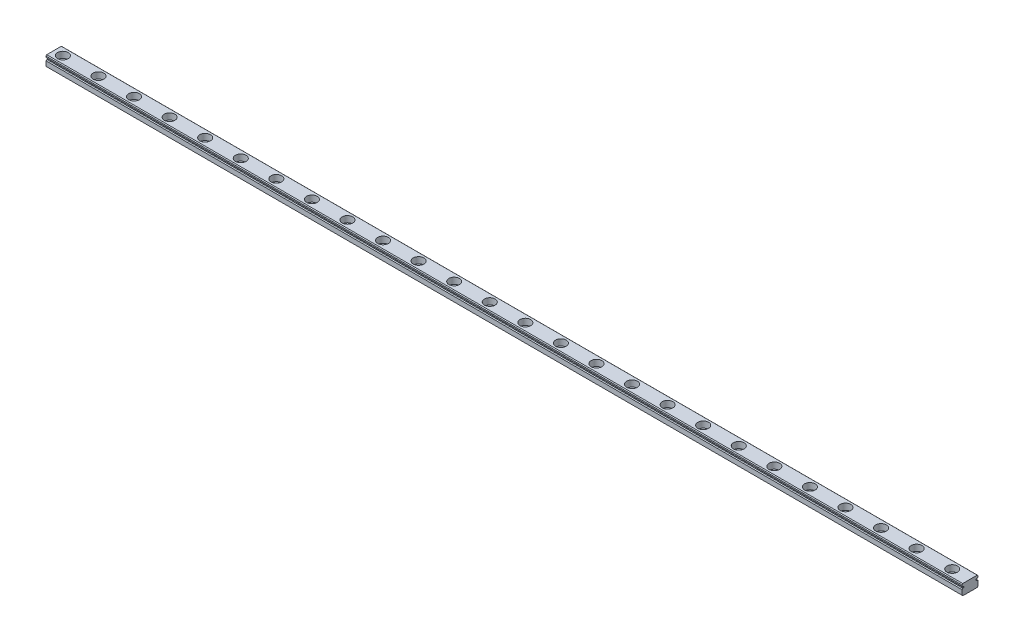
ISO-10303-21;
HEADER;
FILE_DESCRIPTION(('STEP AP214'),'2;1');
FILE_NAME('part.step','',(''),(''),'','','');
FILE_SCHEMA(('AUTOMOTIVE_DESIGN { 1 0 10303 214 1 1 1 1 }'));
ENDSEC;
DATA;
#1=APPLICATION_CONTEXT('core data for automotive mechanical design processes');
#2=APPLICATION_PROTOCOL_DEFINITION('international standard','automotive_design',2000,#1);
#3=PRODUCT_CONTEXT('',#1,'mechanical');
#4=PRODUCT('Part','Part','',(#3));
#5=PRODUCT_RELATED_PRODUCT_CATEGORY('part','',(#4));
#6=PRODUCT_DEFINITION_FORMATION('','',#4);
#7=PRODUCT_DEFINITION_CONTEXT('part definition',#1,'design');
#8=PRODUCT_DEFINITION('design','',#6,#7);
#9=PRODUCT_DEFINITION_SHAPE('','',#8);
#10=(LENGTH_UNIT() NAMED_UNIT(*) SI_UNIT(.MILLI.,.METRE.));
#11=(NAMED_UNIT(*) PLANE_ANGLE_UNIT() SI_UNIT($,.RADIAN.));
#12=(NAMED_UNIT(*) SI_UNIT($,.STERADIAN.) SOLID_ANGLE_UNIT());
#13=UNCERTAINTY_MEASURE_WITH_UNIT(LENGTH_MEASURE(1.E-05),#10,'distance_accuracy_value','');
#14=(GEOMETRIC_REPRESENTATION_CONTEXT(3) GLOBAL_UNCERTAINTY_ASSIGNED_CONTEXT((#13)) GLOBAL_UNIT_ASSIGNED_CONTEXT((#10,
#11,#12)) REPRESENTATION_CONTEXT('',''));
#15=CARTESIAN_POINT('',(0.,0.,0.));
#16=DIRECTION('',(0.,0.,1.));
#17=DIRECTION('',(1.,0.,0.));
#18=AXIS2_PLACEMENT_3D('',#15,#16,#17);
#19=CARTESIAN_POINT('',(-465.,0.,4.5));
#20=DIRECTION('',(0.,-1.,0.));
#21=DIRECTION('',(0.,0.,-1.));
#22=AXIS2_PLACEMENT_3D('',#19,#20,#21);
#23=PLANE('',#22);
#24=CARTESIAN_POINT('',(-440.,0.,0.));
#25=DIRECTION('',(0.,1.,0.));
#26=DIRECTION('',(0.,0.,1.));
#27=AXIS2_PLACEMENT_3D('',#24,#25,#26);
#28=CIRCLE('',#27,1.75000000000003);
#29=CARTESIAN_POINT('',(-440.,0.,1.75000000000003));
#30=VERTEX_POINT('',#29);
#31=EDGE_CURVE('E841',#30,#30,#28,.T.);
#32=ORIENTED_EDGE('',*,*,#31,.T.);
#33=EDGE_LOOP('',(#32));
#34=FACE_BOUND('',#33,.T.);
#35=CARTESIAN_POINT('',(-380.,0.,0.));
#36=DIRECTION('',(0.,1.,0.));
#37=DIRECTION('',(0.,0.,1.));
#38=AXIS2_PLACEMENT_3D('',#35,#36,#37);
#39=CIRCLE('',#38,1.75000000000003);
#40=CARTESIAN_POINT('',(-380.,0.,1.75000000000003));
#41=VERTEX_POINT('',#40);
#42=EDGE_CURVE('E817',#41,#41,#39,.T.);
#43=ORIENTED_EDGE('',*,*,#42,.T.);
#44=EDGE_LOOP('',(#43));
#45=FACE_BOUND('',#44,.T.);
#46=CARTESIAN_POINT('',(-340.,0.,0.));
#47=DIRECTION('',(0.,1.,0.));
#48=DIRECTION('',(0.,0.,1.));
#49=AXIS2_PLACEMENT_3D('',#46,#47,#48);
#50=CIRCLE('',#49,1.75000000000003);
#51=CARTESIAN_POINT('',(-340.,0.,1.75000000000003));
#52=VERTEX_POINT('',#51);
#53=EDGE_CURVE('E793',#52,#52,#50,.T.);
#54=ORIENTED_EDGE('',*,*,#53,.T.);
#55=EDGE_LOOP('',(#54));
#56=FACE_BOUND('',#55,.T.);
#57=CARTESIAN_POINT('',(-360.,0.,0.));
#58=DIRECTION('',(0.,1.,0.));
#59=DIRECTION('',(0.,0.,1.));
#60=AXIS2_PLACEMENT_3D('',#57,#58,#59);
#61=CIRCLE('',#60,1.75000000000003);
#62=CARTESIAN_POINT('',(-360.,0.,1.75000000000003));
#63=VERTEX_POINT('',#62);
#64=EDGE_CURVE('E769',#63,#63,#61,.T.);
#65=ORIENTED_EDGE('',*,*,#64,.T.);
#66=EDGE_LOOP('',(#65));
#67=FACE_BOUND('',#66,.T.);
#68=CARTESIAN_POINT('',(-260.,0.,0.));
#69=DIRECTION('',(0.,1.,0.));
#70=DIRECTION('',(0.,0.,1.));
#71=AXIS2_PLACEMENT_3D('',#68,#69,#70);
#72=CIRCLE('',#71,1.75000000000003);
#73=CARTESIAN_POINT('',(-260.,0.,1.75000000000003));
#74=VERTEX_POINT('',#73);
#75=EDGE_CURVE('E745',#74,#74,#72,.T.);
#76=ORIENTED_EDGE('',*,*,#75,.T.);
#77=EDGE_LOOP('',(#76));
#78=FACE_BOUND('',#77,.T.);
#79=CARTESIAN_POINT('',(-220.,0.,0.));
#80=DIRECTION('',(0.,1.,0.));
#81=DIRECTION('',(0.,0.,1.));
#82=AXIS2_PLACEMENT_3D('',#79,#80,#81);
#83=CIRCLE('',#82,1.75);
#84=CARTESIAN_POINT('',(-220.,0.,1.75));
#85=VERTEX_POINT('',#84);
#86=EDGE_CURVE('E721',#85,#85,#83,.T.);
#87=ORIENTED_EDGE('',*,*,#86,.T.);
#88=EDGE_LOOP('',(#87));
#89=FACE_BOUND('',#88,.T.);
#90=CARTESIAN_POINT('',(-240.,0.,0.));
#91=DIRECTION('',(0.,1.,0.));
#92=DIRECTION('',(0.,0.,1.));
#93=AXIS2_PLACEMENT_3D('',#90,#91,#92);
#94=CIRCLE('',#93,1.75);
#95=CARTESIAN_POINT('',(-240.,0.,1.75));
#96=VERTEX_POINT('',#95);
#97=EDGE_CURVE('E697',#96,#96,#94,.T.);
#98=ORIENTED_EDGE('',*,*,#97,.T.);
#99=EDGE_LOOP('',(#98));
#100=FACE_BOUND('',#99,.T.);
#101=CARTESIAN_POINT('',(-140.,0.,0.));
#102=DIRECTION('',(0.,1.,0.));
#103=DIRECTION('',(0.,0.,1.));
#104=AXIS2_PLACEMENT_3D('',#101,#102,#103);
#105=CIRCLE('',#104,1.75);
#106=CARTESIAN_POINT('',(-140.,0.,1.75));
#107=VERTEX_POINT('',#106);
#108=EDGE_CURVE('E673',#107,#107,#105,.T.);
#109=ORIENTED_EDGE('',*,*,#108,.T.);
#110=EDGE_LOOP('',(#109));
#111=FACE_BOUND('',#110,.T.);
#112=CARTESIAN_POINT('',(-100.,0.,0.));
#113=DIRECTION('',(0.,1.,0.));
#114=DIRECTION('',(0.,0.,1.));
#115=AXIS2_PLACEMENT_3D('',#112,#113,#114);
#116=CIRCLE('',#115,1.75000000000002);
#117=CARTESIAN_POINT('',(-100.,0.,1.75000000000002));
#118=VERTEX_POINT('',#117);
#119=EDGE_CURVE('E649',#118,#118,#116,.T.);
#120=ORIENTED_EDGE('',*,*,#119,.T.);
#121=EDGE_LOOP('',(#120));
#122=FACE_BOUND('',#121,.T.);
#123=CARTESIAN_POINT('',(-80.,0.,0.));
#124=DIRECTION('',(0.,1.,0.));
#125=DIRECTION('',(0.,0.,1.));
#126=AXIS2_PLACEMENT_3D('',#123,#124,#125);
#127=CIRCLE('',#126,1.75000000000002);
#128=CARTESIAN_POINT('',(-80.,0.,1.75000000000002));
#129=VERTEX_POINT('',#128);
#130=EDGE_CURVE('E637',#129,#129,#127,.T.);
#131=ORIENTED_EDGE('',*,*,#130,.T.);
#132=EDGE_LOOP('',(#131));
#133=FACE_BOUND('',#132,.T.);
#134=CARTESIAN_POINT('',(-120.,0.,0.));
#135=DIRECTION('',(0.,1.,0.));
#136=DIRECTION('',(0.,0.,1.));
#137=AXIS2_PLACEMENT_3D('',#134,#135,#136);
#138=CIRCLE('',#137,1.75000000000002);
#139=CARTESIAN_POINT('',(-120.,0.,1.75000000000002));
#140=VERTEX_POINT('',#139);
#141=EDGE_CURVE('E625',#140,#140,#138,.T.);
#142=ORIENTED_EDGE('',*,*,#141,.T.);
#143=EDGE_LOOP('',(#142));
#144=FACE_BOUND('',#143,.T.);
#145=CARTESIAN_POINT('',(-40.,0.,0.));
#146=DIRECTION('',(0.,1.,0.));
#147=DIRECTION('',(0.,0.,1.));
#148=AXIS2_PLACEMENT_3D('',#145,#146,#147);
#149=CIRCLE('',#148,1.75000000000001);
#150=CARTESIAN_POINT('',(-40.,0.,1.75000000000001));
#151=VERTEX_POINT('',#150);
#152=EDGE_CURVE('E613',#151,#151,#149,.T.);
#153=ORIENTED_EDGE('',*,*,#152,.T.);
#154=EDGE_LOOP('',(#153));
#155=FACE_BOUND('',#154,.T.);
#156=CARTESIAN_POINT('',(-20.,0.,0.));
#157=DIRECTION('',(0.,1.,0.));
#158=DIRECTION('',(0.,0.,1.));
#159=AXIS2_PLACEMENT_3D('',#156,#157,#158);
#160=CIRCLE('',#159,1.75000000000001);
#161=CARTESIAN_POINT('',(-20.,0.,1.75000000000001));
#162=VERTEX_POINT('',#161);
#163=EDGE_CURVE('E601',#162,#162,#160,.T.);
#164=ORIENTED_EDGE('',*,*,#163,.T.);
#165=EDGE_LOOP('',(#164));
#166=FACE_BOUND('',#165,.T.);
#167=CARTESIAN_POINT('',(-60.,0.,0.));
#168=DIRECTION('',(0.,1.,0.));
#169=DIRECTION('',(0.,0.,1.));
#170=AXIS2_PLACEMENT_3D('',#167,#168,#169);
#171=CIRCLE('',#170,1.75000000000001);
#172=CARTESIAN_POINT('',(-60.,0.,1.75000000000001));
#173=VERTEX_POINT('',#172);
#174=EDGE_CURVE('E589',#173,#173,#171,.T.);
#175=ORIENTED_EDGE('',*,*,#174,.T.);
#176=EDGE_LOOP('',(#175));
#177=FACE_BOUND('',#176,.T.);
#178=CARTESIAN_POINT('',(40.,0.,0.));
#179=DIRECTION('',(0.,-1.,0.));
#180=DIRECTION('',(0.,0.,-1.));
#181=AXIS2_PLACEMENT_3D('',#178,#179,#180);
#182=CIRCLE('',#181,1.9500000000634);
#183=CARTESIAN_POINT('',(40.,0.,-1.9500000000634));
#184=VERTEX_POINT('',#183);
#185=EDGE_CURVE('E401',#184,#184,#182,.F.);
#186=ORIENTED_EDGE('',*,*,#185,.T.);
#187=EDGE_LOOP('',(#186));
#188=FACE_BOUND('',#187,.T.);
#189=CARTESIAN_POINT('',(20.,0.,0.));
#190=DIRECTION('',(0.,-1.,0.));
#191=DIRECTION('',(0.,0.,-1.));
#192=AXIS2_PLACEMENT_3D('',#189,#190,#191);
#193=CIRCLE('',#192,1.9500000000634);
#194=CARTESIAN_POINT('',(20.,0.,-1.9500000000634));
#195=VERTEX_POINT('',#194);
#196=EDGE_CURVE('E398',#195,#195,#193,.F.);
#197=ORIENTED_EDGE('',*,*,#196,.T.);
#198=EDGE_LOOP('',(#197));
#199=FACE_BOUND('',#198,.T.);
#200=CARTESIAN_POINT('',(0.,0.,0.));
#201=DIRECTION('',(0.,-1.,0.));
#202=DIRECTION('',(0.,0.,-1.));
#203=AXIS2_PLACEMENT_3D('',#200,#201,#202);
#204=CIRCLE('',#203,1.9500000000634);
#205=CARTESIAN_POINT('',(0.,0.,-1.9500000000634));
#206=VERTEX_POINT('',#205);
#207=EDGE_CURVE('E389',#206,#206,#204,.F.);
#208=ORIENTED_EDGE('',*,*,#207,.T.);
#209=EDGE_LOOP('',(#208));
#210=FACE_BOUND('',#209,.T.);
#211=DIRECTION('',(0.,0.,-1.));
#212=VECTOR('',#211,1.);
#213=CARTESIAN_POINT('',(-465.,0.,4.5));
#214=LINE('',#213,#212);
#215=CARTESIAN_POINT('',(-465.,0.,-2.9));
#216=VERTEX_POINT('',#215);
#217=CARTESIAN_POINT('',(-465.,0.,-4.));
#218=VERTEX_POINT('',#217);
#219=EDGE_CURVE('E358',#216,#218,#214,.T.);
#220=ORIENTED_EDGE('',*,*,#219,.T.);
#221=DIRECTION('',(1.,0.,0.));
#222=VECTOR('',#221,1.);
#223=CARTESIAN_POINT('',(-465.,0.,-4.));
#224=LINE('',#223,#222);
#225=CARTESIAN_POINT('',(50.,0.,-4.));
#226=VERTEX_POINT('',#225);
#227=EDGE_CURVE('E415',#218,#226,#224,.T.);
#228=ORIENTED_EDGE('',*,*,#227,.T.);
#229=DIRECTION('',(0.,0.,-1.));
#230=VECTOR('',#229,1.);
#231=CARTESIAN_POINT('',(50.,0.,4.5));
#232=LINE('',#231,#230);
#233=CARTESIAN_POINT('',(50.,0.,4.));
#234=VERTEX_POINT('',#233);
#235=EDGE_CURVE('E377',#234,#226,#232,.T.);
#236=ORIENTED_EDGE('',*,*,#235,.F.);
#237=DIRECTION('',(-1.,0.,0.));
#238=VECTOR('',#237,1.);
#239=CARTESIAN_POINT('',(-465.,0.,4.));
#240=LINE('',#239,#238);
#241=CARTESIAN_POINT('',(-465.,0.,4.));
#242=VERTEX_POINT('',#241);
#243=EDGE_CURVE('E413',#234,#242,#240,.T.);
#244=ORIENTED_EDGE('',*,*,#243,.T.);
#245=CARTESIAN_POINT('',(-465.,0.,-2.1));
#246=VERTEX_POINT('',#245);
#247=EDGE_CURVE('E359',#242,#246,#214,.T.);
#248=ORIENTED_EDGE('',*,*,#247,.T.);
#249=DIRECTION('',(-1.,0.,0.));
#250=VECTOR('',#249,1.);
#251=CARTESIAN_POINT('',(-405.,0.,-2.1));
#252=LINE('',#251,#250);
#253=CARTESIAN_POINT('',(-405.,0.,-2.1));
#254=VERTEX_POINT('',#253);
#255=EDGE_CURVE('E289',#254,#246,#252,.T.);
#256=ORIENTED_EDGE('',*,*,#255,.F.);
#257=DIRECTION('',(0.,0.,1.));
#258=VECTOR('',#257,1.);
#259=CARTESIAN_POINT('',(-405.,0.,-2.9));
#260=LINE('',#259,#258);
#261=CARTESIAN_POINT('',(-405.,0.,-2.9));
#262=VERTEX_POINT('',#261);
#263=EDGE_CURVE('E284',#262,#254,#260,.T.);
#264=ORIENTED_EDGE('',*,*,#263,.F.);
#265=DIRECTION('',(-1.,0.,0.));
#266=VECTOR('',#265,1.);
#267=CARTESIAN_POINT('',(-405.,0.,-2.9));
#268=LINE('',#267,#266);
#269=EDGE_CURVE('E287',#262,#216,#268,.T.);
#270=ORIENTED_EDGE('',*,*,#269,.T.);
#271=EDGE_LOOP('',(#220,#228,#236,#244,#248,#256,#264,#270));
#272=FACE_BOUND('',#271,.T.);
#273=CARTESIAN_POINT('',(-180.,0.,0.));
#274=DIRECTION('',(0.,1.,0.));
#275=DIRECTION('',(0.,0.,1.));
#276=AXIS2_PLACEMENT_3D('',#273,#274,#275);
#277=CIRCLE('',#276,1.75);
#278=CARTESIAN_POINT('',(-180.,0.,1.75));
#279=VERTEX_POINT('',#278);
#280=EDGE_CURVE('E661',#279,#279,#277,.T.);
#281=ORIENTED_EDGE('',*,*,#280,.T.);
#282=EDGE_LOOP('',(#281));
#283=FACE_BOUND('',#282,.T.);
#284=CARTESIAN_POINT('',(-160.,0.,0.));
#285=DIRECTION('',(0.,1.,0.));
#286=DIRECTION('',(0.,0.,1.));
#287=AXIS2_PLACEMENT_3D('',#284,#285,#286);
#288=CIRCLE('',#287,1.75);
#289=CARTESIAN_POINT('',(-160.,0.,1.75));
#290=VERTEX_POINT('',#289);
#291=EDGE_CURVE('E685',#290,#290,#288,.T.);
#292=ORIENTED_EDGE('',*,*,#291,.T.);
#293=EDGE_LOOP('',(#292));
#294=FACE_BOUND('',#293,.T.);
#295=CARTESIAN_POINT('',(-200.,0.,0.));
#296=DIRECTION('',(0.,1.,0.));
#297=DIRECTION('',(0.,0.,1.));
#298=AXIS2_PLACEMENT_3D('',#295,#296,#297);
#299=CIRCLE('',#298,1.75);
#300=CARTESIAN_POINT('',(-200.,0.,1.75));
#301=VERTEX_POINT('',#300);
#302=EDGE_CURVE('E709',#301,#301,#299,.T.);
#303=ORIENTED_EDGE('',*,*,#302,.T.);
#304=EDGE_LOOP('',(#303));
#305=FACE_BOUND('',#304,.T.);
#306=CARTESIAN_POINT('',(-300.,0.,0.));
#307=DIRECTION('',(0.,1.,0.));
#308=DIRECTION('',(0.,0.,1.));
#309=AXIS2_PLACEMENT_3D('',#306,#307,#308);
#310=CIRCLE('',#309,1.75000000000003);
#311=CARTESIAN_POINT('',(-300.,0.,1.75000000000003));
#312=VERTEX_POINT('',#311);
#313=EDGE_CURVE('E733',#312,#312,#310,.T.);
#314=ORIENTED_EDGE('',*,*,#313,.T.);
#315=EDGE_LOOP('',(#314));
#316=FACE_BOUND('',#315,.T.);
#317=CARTESIAN_POINT('',(-280.,0.,0.));
#318=DIRECTION('',(0.,1.,0.));
#319=DIRECTION('',(0.,0.,1.));
#320=AXIS2_PLACEMENT_3D('',#317,#318,#319);
#321=CIRCLE('',#320,1.75000000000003);
#322=CARTESIAN_POINT('',(-280.,0.,1.75000000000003));
#323=VERTEX_POINT('',#322);
#324=EDGE_CURVE('E757',#323,#323,#321,.T.);
#325=ORIENTED_EDGE('',*,*,#324,.T.);
#326=EDGE_LOOP('',(#325));
#327=FACE_BOUND('',#326,.T.);
#328=CARTESIAN_POINT('',(-320.,0.,0.));
#329=DIRECTION('',(0.,1.,0.));
#330=DIRECTION('',(0.,0.,1.));
#331=AXIS2_PLACEMENT_3D('',#328,#329,#330);
#332=CIRCLE('',#331,1.75000000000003);
#333=CARTESIAN_POINT('',(-320.,0.,1.75000000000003));
#334=VERTEX_POINT('',#333);
#335=EDGE_CURVE('E781',#334,#334,#332,.T.);
#336=ORIENTED_EDGE('',*,*,#335,.T.);
#337=EDGE_LOOP('',(#336));
#338=FACE_BOUND('',#337,.T.);
#339=CARTESIAN_POINT('',(-420.,0.,0.));
#340=DIRECTION('',(0.,1.,0.));
#341=DIRECTION('',(0.,0.,1.));
#342=AXIS2_PLACEMENT_3D('',#339,#340,#341);
#343=CIRCLE('',#342,1.75000000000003);
#344=CARTESIAN_POINT('',(-420.,0.,1.75000000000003));
#345=VERTEX_POINT('',#344);
#346=EDGE_CURVE('E805',#345,#345,#343,.T.);
#347=ORIENTED_EDGE('',*,*,#346,.T.);
#348=EDGE_LOOP('',(#347));
#349=FACE_BOUND('',#348,.T.);
#350=CARTESIAN_POINT('',(-400.,0.,0.));
#351=DIRECTION('',(0.,1.,0.));
#352=DIRECTION('',(0.,0.,1.));
#353=AXIS2_PLACEMENT_3D('',#350,#351,#352);
#354=CIRCLE('',#353,1.75000000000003);
#355=CARTESIAN_POINT('',(-400.,0.,1.75000000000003));
#356=VERTEX_POINT('',#355);
#357=EDGE_CURVE('E829',#356,#356,#354,.T.);
#358=ORIENTED_EDGE('',*,*,#357,.T.);
#359=EDGE_LOOP('',(#358));
#360=FACE_BOUND('',#359,.T.);
#361=CARTESIAN_POINT('',(-460.,0.,0.));
#362=DIRECTION('',(0.,1.,0.));
#363=DIRECTION('',(0.,0.,1.));
#364=AXIS2_PLACEMENT_3D('',#361,#362,#363);
#365=CIRCLE('',#364,1.75000000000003);
#366=CARTESIAN_POINT('',(-460.,0.,1.75000000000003));
#367=VERTEX_POINT('',#366);
#368=EDGE_CURVE('E852',#367,#367,#365,.T.);
#369=ORIENTED_EDGE('',*,*,#368,.T.);
#370=EDGE_LOOP('',(#369));
#371=FACE_BOUND('',#370,.T.);
#372=ADVANCED_FACE('F34',(#34,#45,#56,#67,#78,#89,#100,#111,#122,#133,#144,#155,#166,#177,#188,
#199,#210,#272,#283,#294,#305,#316,#327,#338,#349,#360,#371),#23,.T.);
#373=CARTESIAN_POINT('',(50.,4.,-4.65));
#374=DIRECTION('',(-1.,0.,0.));
#375=DIRECTION('',(0.,0.,1.));
#376=AXIS2_PLACEMENT_3D('',#373,#374,#375);
#377=CYLINDRICAL_SURFACE('',#376,0.789999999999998);
#378=CARTESIAN_POINT('',(50.,4.,-4.65));
#379=DIRECTION('',(-1.,0.,0.));
#380=DIRECTION('',(0.,0.,1.));
#381=AXIS2_PLACEMENT_3D('',#378,#379,#380);
#382=CIRCLE('',#381,0.789999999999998);
#383=CARTESIAN_POINT('',(50.,4.4,-3.96875114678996));
#384=VERTEX_POINT('',#383);
#385=CARTESIAN_POINT('',(50.,4.77562877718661,-4.5));
#386=VERTEX_POINT('',#385);
#387=EDGE_CURVE('E271',#384,#386,#382,.T.);
#388=ORIENTED_EDGE('',*,*,#387,.F.);
#389=DIRECTION('',(-1.,0.,0.));
#390=VECTOR('',#389,1.);
#391=CARTESIAN_POINT('',(50.,4.4,-3.96875114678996));
#392=LINE('',#391,#390);
#393=CARTESIAN_POINT('',(-465.,4.4,-3.96875114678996));
#394=VERTEX_POINT('',#393);
#395=EDGE_CURVE('E259',#384,#394,#392,.T.);
#396=ORIENTED_EDGE('',*,*,#395,.T.);
#397=CARTESIAN_POINT('',(-465.,4.,-4.65));
#398=DIRECTION('',(-1.,0.,0.));
#399=DIRECTION('',(0.,0.,1.));
#400=AXIS2_PLACEMENT_3D('',#397,#398,#399);
#401=CIRCLE('',#400,0.789999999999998);
#402=CARTESIAN_POINT('',(-465.,4.77562877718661,-4.5));
#403=VERTEX_POINT('',#402);
#404=EDGE_CURVE('E262',#394,#403,#401,.T.);
#405=ORIENTED_EDGE('',*,*,#404,.T.);
#406=DIRECTION('',(-1.,0.,0.));
#407=VECTOR('',#406,1.);
#408=CARTESIAN_POINT('',(50.,4.77562877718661,-4.5));
#409=LINE('',#408,#407);
#410=EDGE_CURVE('E270',#386,#403,#409,.T.);
#411=ORIENTED_EDGE('',*,*,#410,.F.);
#412=EDGE_LOOP('',(#388,#396,#405,#411));
#413=FACE_BOUND('',#412,.T.);
#414=ADVANCED_FACE('F454',(#413),#377,.F.);
#415=CARTESIAN_POINT('',(-465.,0.,-4.5));
#416=DIRECTION('',(0.,0.,-1.));
#417=DIRECTION('',(0.,1.,0.));
#418=AXIS2_PLACEMENT_3D('',#415,#416,#417);
#419=PLANE('',#418);
#420=DIRECTION('',(0.,1.,0.));
#421=VECTOR('',#420,1.);
#422=CARTESIAN_POINT('',(50.,0.,-4.5));
#423=LINE('',#422,#421);
#424=CARTESIAN_POINT('',(50.,0.5,-4.5));
#425=VERTEX_POINT('',#424);
#426=CARTESIAN_POINT('',(50.,3.22437122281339,-4.5));
#427=VERTEX_POINT('',#426);
#428=EDGE_CURVE('E380',#425,#427,#423,.T.);
#429=ORIENTED_EDGE('',*,*,#428,.F.);
#430=DIRECTION('',(-1.,0.,0.));
#431=VECTOR('',#430,1.);
#432=CARTESIAN_POINT('',(-465.,0.5,-4.5));
#433=LINE('',#432,#431);
#434=CARTESIAN_POINT('',(-465.,0.5,-4.5));
#435=VERTEX_POINT('',#434);
#436=EDGE_CURVE('E57',#425,#435,#433,.T.);
#437=ORIENTED_EDGE('',*,*,#436,.T.);
#438=DIRECTION('',(0.,1.,0.));
#439=VECTOR('',#438,1.);
#440=CARTESIAN_POINT('',(-465.,0.,-4.5));
#441=LINE('',#440,#439);
#442=CARTESIAN_POINT('',(-465.,3.22437122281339,-4.5));
#443=VERTEX_POINT('',#442);
#444=EDGE_CURVE('E362',#435,#443,#441,.T.);
#445=ORIENTED_EDGE('',*,*,#444,.T.);
#446=DIRECTION('',(-1.,0.,0.));
#447=VECTOR('',#446,1.);
#448=CARTESIAN_POINT('',(50.,3.22437122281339,-4.5));
#449=LINE('',#448,#447);
#450=EDGE_CURVE('E275',#427,#443,#449,.T.);
#451=ORIENTED_EDGE('',*,*,#450,.F.);
#452=EDGE_LOOP('',(#429,#437,#445,#451));
#453=FACE_BOUND('',#452,.T.);
#454=ADVANCED_FACE('F437',(#453),#419,.T.);
#455=CARTESIAN_POINT('',(50.,4.,4.65));
#456=DIRECTION('',(-1.,0.,0.));
#457=DIRECTION('',(0.,0.,1.));
#458=AXIS2_PLACEMENT_3D('',#455,#456,#457);
#459=CYLINDRICAL_SURFACE('',#458,0.790000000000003);
#460=CARTESIAN_POINT('',(50.,4.,4.65));
#461=DIRECTION('',(-1.,0.,0.));
#462=DIRECTION('',(0.,0.,1.));
#463=AXIS2_PLACEMENT_3D('',#460,#461,#462);
#464=CIRCLE('',#463,0.790000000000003);
#465=CARTESIAN_POINT('',(50.,3.6,3.96875114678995));
#466=VERTEX_POINT('',#465);
#467=CARTESIAN_POINT('',(50.,3.22437122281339,4.5));
#468=VERTEX_POINT('',#467);
#469=EDGE_CURVE('E341',#466,#468,#464,.T.);
#470=ORIENTED_EDGE('',*,*,#469,.F.);
#471=DIRECTION('',(-1.,0.,0.));
#472=VECTOR('',#471,1.);
#473=CARTESIAN_POINT('',(50.,3.6,3.96875114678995));
#474=LINE('',#473,#472);
#475=CARTESIAN_POINT('',(-465.,3.6,3.96875114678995));
#476=VERTEX_POINT('',#475);
#477=EDGE_CURVE('E324',#466,#476,#474,.T.);
#478=ORIENTED_EDGE('',*,*,#477,.T.);
#479=CARTESIAN_POINT('',(-465.,4.,4.65));
#480=DIRECTION('',(-1.,0.,0.));
#481=DIRECTION('',(0.,0.,1.));
#482=AXIS2_PLACEMENT_3D('',#479,#480,#481);
#483=CIRCLE('',#482,0.790000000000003);
#484=CARTESIAN_POINT('',(-465.,3.22437122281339,4.5));
#485=VERTEX_POINT('',#484);
#486=EDGE_CURVE('E327',#476,#485,#483,.T.);
#487=ORIENTED_EDGE('',*,*,#486,.T.);
#488=DIRECTION('',(-1.,0.,0.));
#489=VECTOR('',#488,1.);
#490=CARTESIAN_POINT('',(50.,3.22437122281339,4.5));
#491=LINE('',#490,#489);
#492=EDGE_CURVE('E340',#468,#485,#491,.T.);
#493=ORIENTED_EDGE('',*,*,#492,.F.);
#494=EDGE_LOOP('',(#470,#478,#487,#493));
#495=FACE_BOUND('',#494,.T.);
#496=ADVANCED_FACE('F503',(#495),#459,.F.);
#497=CARTESIAN_POINT('',(-465.,5.5,4.5));
#498=DIRECTION('',(0.,0.,1.));
#499=DIRECTION('',(0.,-1.,0.));
#500=AXIS2_PLACEMENT_3D('',#497,#498,#499);
#501=PLANE('',#500);
#502=DIRECTION('',(-1.,0.,0.));
#503=VECTOR('',#502,1.);
#504=CARTESIAN_POINT('',(50.,4.77562877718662,4.5));
#505=LINE('',#504,#503);
#506=CARTESIAN_POINT('',(50.,4.77562877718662,4.5));
#507=VERTEX_POINT('',#506);
#508=CARTESIAN_POINT('',(-465.,4.77562877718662,4.5));
#509=VERTEX_POINT('',#508);
#510=EDGE_CURVE('E345',#507,#509,#505,.T.);
#511=ORIENTED_EDGE('',*,*,#510,.F.);
#512=DIRECTION('',(0.,-1.,0.));
#513=VECTOR('',#512,1.);
#514=CARTESIAN_POINT('',(50.,5.5,4.5));
#515=LINE('',#514,#513);
#516=CARTESIAN_POINT('',(50.,5.5,4.5));
#517=VERTEX_POINT('',#516);
#518=EDGE_CURVE('E374',#517,#507,#515,.T.);
#519=ORIENTED_EDGE('',*,*,#518,.F.);
#520=DIRECTION('',(1.,0.,0.));
#521=VECTOR('',#520,1.);
#522=CARTESIAN_POINT('',(-465.,5.5,4.5));
#523=LINE('',#522,#521);
#524=CARTESIAN_POINT('',(-465.,5.5,4.5));
#525=VERTEX_POINT('',#524);
#526=EDGE_CURVE('E370',#525,#517,#523,.T.);
#527=ORIENTED_EDGE('',*,*,#526,.F.);
#528=DIRECTION('',(0.,-1.,0.));
#529=VECTOR('',#528,1.);
#530=CARTESIAN_POINT('',(-465.,5.5,4.5));
#531=LINE('',#530,#529);
#532=EDGE_CURVE('E355',#525,#509,#531,.T.);
#533=ORIENTED_EDGE('',*,*,#532,.T.);
#534=EDGE_LOOP('',(#511,#519,#527,#533));
#535=FACE_BOUND('',#534,.T.);
#536=ADVANCED_FACE('F476',(#535),#501,.T.);
#537=CARTESIAN_POINT('',(-465.,5.15818592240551,3.56023240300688));
#538=DIRECTION('',(1.,0.,0.));
#539=DIRECTION('',(0.,0.,-1.));
#540=AXIS2_PLACEMENT_3D('',#537,#538,#539);
#541=CYLINDRICAL_SURFACE('',#540,0.999999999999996);
#542=CARTESIAN_POINT('',(50.,5.15818592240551,3.56023240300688));
#543=DIRECTION('',(1.,0.,0.));
#544=DIRECTION('',(0.,0.,-1.));
#545=AXIS2_PLACEMENT_3D('',#542,#543,#544);
#546=CIRCLE('',#545,0.999999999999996);
#547=CARTESIAN_POINT('',(50.,6.,4.1));
#548=VERTEX_POINT('',#547);
#549=EDGE_CURVE('E347',#548,#517,#546,.T.);
#550=ORIENTED_EDGE('',*,*,#549,.F.);
#551=DIRECTION('',(1.,0.,0.));
#552=VECTOR('',#551,1.);
#553=CARTESIAN_POINT('',(-465.,6.,4.1));
#554=LINE('',#553,#552);
#555=CARTESIAN_POINT('',(-465.,6.,4.1));
#556=VERTEX_POINT('',#555);
#557=EDGE_CURVE('E387',#556,#548,#554,.T.);
#558=ORIENTED_EDGE('',*,*,#557,.F.);
#559=CARTESIAN_POINT('',(-465.,5.15818592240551,3.56023240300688));
#560=DIRECTION('',(1.,0.,0.));
#561=DIRECTION('',(0.,0.,-1.));
#562=AXIS2_PLACEMENT_3D('',#559,#560,#561);
#563=CIRCLE('',#562,0.999999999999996);
#564=EDGE_CURVE('E350',#556,#525,#563,.T.);
#565=ORIENTED_EDGE('',*,*,#564,.T.);
#566=ORIENTED_EDGE('',*,*,#526,.T.);
#567=EDGE_LOOP('',(#550,#558,#565,#566));
#568=FACE_BOUND('',#567,.T.);
#569=ADVANCED_FACE('F472',(#568),#541,.T.);
#570=CARTESIAN_POINT('',(-465.,6.,-4.09999999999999));
#571=DIRECTION('',(0.,1.,0.));
#572=DIRECTION('',(0.,0.,1.));
#573=AXIS2_PLACEMENT_3D('',#570,#571,#572);
#574=PLANE('',#573);
#575=CARTESIAN_POINT('',(-460.,6.,0.));
#576=DIRECTION('',(0.,1.,0.));
#577=DIRECTION('',(0.,0.,1.));
#578=AXIS2_PLACEMENT_3D('',#575,#576,#577);
#579=CIRCLE('',#578,3.);
#580=CARTESIAN_POINT('',(-460.,6.,3.));
#581=VERTEX_POINT('',#580);
#582=EDGE_CURVE('E861',#581,#581,#579,.T.);
#583=ORIENTED_EDGE('',*,*,#582,.F.);
#584=EDGE_LOOP('',(#583));
#585=FACE_BOUND('',#584,.T.);
#586=CARTESIAN_POINT('',(-440.,6.,0.));
#587=DIRECTION('',(0.,1.,0.));
#588=DIRECTION('',(0.,0.,1.));
#589=AXIS2_PLACEMENT_3D('',#586,#587,#588);
#590=CIRCLE('',#589,3.);
#591=CARTESIAN_POINT('',(-440.,6.,3.));
#592=VERTEX_POINT('',#591);
#593=EDGE_CURVE('E849',#592,#592,#590,.T.);
#594=ORIENTED_EDGE('',*,*,#593,.F.);
#595=EDGE_LOOP('',(#594));
#596=FACE_BOUND('',#595,.T.);
#597=CARTESIAN_POINT('',(-400.,6.,0.));
#598=DIRECTION('',(0.,1.,0.));
#599=DIRECTION('',(0.,0.,1.));
#600=AXIS2_PLACEMENT_3D('',#597,#598,#599);
#601=CIRCLE('',#600,3.);
#602=CARTESIAN_POINT('',(-400.,6.,3.));
#603=VERTEX_POINT('',#602);
#604=EDGE_CURVE('E838',#603,#603,#601,.T.);
#605=ORIENTED_EDGE('',*,*,#604,.F.);
#606=EDGE_LOOP('',(#605));
#607=FACE_BOUND('',#606,.T.);
#608=CARTESIAN_POINT('',(-380.,6.,0.));
#609=DIRECTION('',(0.,1.,0.));
#610=DIRECTION('',(0.,0.,1.));
#611=AXIS2_PLACEMENT_3D('',#608,#609,#610);
#612=CIRCLE('',#611,3.);
#613=CARTESIAN_POINT('',(-380.,6.,3.));
#614=VERTEX_POINT('',#613);
#615=EDGE_CURVE('E826',#614,#614,#612,.T.);
#616=ORIENTED_EDGE('',*,*,#615,.F.);
#617=EDGE_LOOP('',(#616));
#618=FACE_BOUND('',#617,.T.);
#619=CARTESIAN_POINT('',(-420.,6.,0.));
#620=DIRECTION('',(0.,1.,0.));
#621=DIRECTION('',(0.,0.,1.));
#622=AXIS2_PLACEMENT_3D('',#619,#620,#621);
#623=CIRCLE('',#622,3.);
#624=CARTESIAN_POINT('',(-420.,6.,3.));
#625=VERTEX_POINT('',#624);
#626=EDGE_CURVE('E814',#625,#625,#623,.T.);
#627=ORIENTED_EDGE('',*,*,#626,.F.);
#628=EDGE_LOOP('',(#627));
#629=FACE_BOUND('',#628,.T.);
#630=CARTESIAN_POINT('',(-340.,6.,0.));
#631=DIRECTION('',(0.,1.,0.));
#632=DIRECTION('',(0.,0.,1.));
#633=AXIS2_PLACEMENT_3D('',#630,#631,#632);
#634=CIRCLE('',#633,3.);
#635=CARTESIAN_POINT('',(-340.,6.,3.));
#636=VERTEX_POINT('',#635);
#637=EDGE_CURVE('E802',#636,#636,#634,.T.);
#638=ORIENTED_EDGE('',*,*,#637,.F.);
#639=EDGE_LOOP('',(#638));
#640=FACE_BOUND('',#639,.T.);
#641=CARTESIAN_POINT('',(-320.,6.,0.));
#642=DIRECTION('',(0.,1.,0.));
#643=DIRECTION('',(0.,0.,1.));
#644=AXIS2_PLACEMENT_3D('',#641,#642,#643);
#645=CIRCLE('',#644,3.);
#646=CARTESIAN_POINT('',(-320.,6.,3.));
#647=VERTEX_POINT('',#646);
#648=EDGE_CURVE('E790',#647,#647,#645,.T.);
#649=ORIENTED_EDGE('',*,*,#648,.F.);
#650=EDGE_LOOP('',(#649));
#651=FACE_BOUND('',#650,.T.);
#652=CARTESIAN_POINT('',(-360.,6.,0.));
#653=DIRECTION('',(0.,1.,0.));
#654=DIRECTION('',(0.,0.,1.));
#655=AXIS2_PLACEMENT_3D('',#652,#653,#654);
#656=CIRCLE('',#655,3.);
#657=CARTESIAN_POINT('',(-360.,6.,3.));
#658=VERTEX_POINT('',#657);
#659=EDGE_CURVE('E778',#658,#658,#656,.T.);
#660=ORIENTED_EDGE('',*,*,#659,.F.);
#661=EDGE_LOOP('',(#660));
#662=FACE_BOUND('',#661,.T.);
#663=CARTESIAN_POINT('',(-280.,6.,0.));
#664=DIRECTION('',(0.,1.,0.));
#665=DIRECTION('',(0.,0.,1.));
#666=AXIS2_PLACEMENT_3D('',#663,#664,#665);
#667=CIRCLE('',#666,3.);
#668=CARTESIAN_POINT('',(-280.,6.,3.));
#669=VERTEX_POINT('',#668);
#670=EDGE_CURVE('E766',#669,#669,#667,.T.);
#671=ORIENTED_EDGE('',*,*,#670,.F.);
#672=EDGE_LOOP('',(#671));
#673=FACE_BOUND('',#672,.T.);
#674=CARTESIAN_POINT('',(-260.,6.,0.));
#675=DIRECTION('',(0.,1.,0.));
#676=DIRECTION('',(0.,0.,1.));
#677=AXIS2_PLACEMENT_3D('',#674,#675,#676);
#678=CIRCLE('',#677,3.);
#679=CARTESIAN_POINT('',(-260.,6.,3.));
#680=VERTEX_POINT('',#679);
#681=EDGE_CURVE('E754',#680,#680,#678,.T.);
#682=ORIENTED_EDGE('',*,*,#681,.F.);
#683=EDGE_LOOP('',(#682));
#684=FACE_BOUND('',#683,.T.);
#685=CARTESIAN_POINT('',(-300.,6.,0.));
#686=DIRECTION('',(0.,1.,0.));
#687=DIRECTION('',(0.,0.,1.));
#688=AXIS2_PLACEMENT_3D('',#685,#686,#687);
#689=CIRCLE('',#688,3.);
#690=CARTESIAN_POINT('',(-300.,6.,3.));
#691=VERTEX_POINT('',#690);
#692=EDGE_CURVE('E742',#691,#691,#689,.T.);
#693=ORIENTED_EDGE('',*,*,#692,.F.);
#694=EDGE_LOOP('',(#693));
#695=FACE_BOUND('',#694,.T.);
#696=CARTESIAN_POINT('',(-220.,6.,0.));
#697=DIRECTION('',(0.,1.,0.));
#698=DIRECTION('',(0.,0.,1.));
#699=AXIS2_PLACEMENT_3D('',#696,#697,#698);
#700=CIRCLE('',#699,3.);
#701=CARTESIAN_POINT('',(-220.,6.,3.));
#702=VERTEX_POINT('',#701);
#703=EDGE_CURVE('E730',#702,#702,#700,.T.);
#704=ORIENTED_EDGE('',*,*,#703,.F.);
#705=EDGE_LOOP('',(#704));
#706=FACE_BOUND('',#705,.T.);
#707=CARTESIAN_POINT('',(-200.,6.,0.));
#708=DIRECTION('',(0.,1.,0.));
#709=DIRECTION('',(0.,0.,1.));
#710=AXIS2_PLACEMENT_3D('',#707,#708,#709);
#711=CIRCLE('',#710,3.);
#712=CARTESIAN_POINT('',(-200.,6.,3.));
#713=VERTEX_POINT('',#712);
#714=EDGE_CURVE('E718',#713,#713,#711,.T.);
#715=ORIENTED_EDGE('',*,*,#714,.F.);
#716=EDGE_LOOP('',(#715));
#717=FACE_BOUND('',#716,.T.);
#718=CARTESIAN_POINT('',(-240.,6.,0.));
#719=DIRECTION('',(0.,1.,0.));
#720=DIRECTION('',(0.,0.,1.));
#721=AXIS2_PLACEMENT_3D('',#718,#719,#720);
#722=CIRCLE('',#721,3.);
#723=CARTESIAN_POINT('',(-240.,6.,3.));
#724=VERTEX_POINT('',#723);
#725=EDGE_CURVE('E706',#724,#724,#722,.T.);
#726=ORIENTED_EDGE('',*,*,#725,.F.);
#727=EDGE_LOOP('',(#726));
#728=FACE_BOUND('',#727,.T.);
#729=CARTESIAN_POINT('',(-160.,6.,0.));
#730=DIRECTION('',(0.,1.,0.));
#731=DIRECTION('',(0.,0.,1.));
#732=AXIS2_PLACEMENT_3D('',#729,#730,#731);
#733=CIRCLE('',#732,3.);
#734=CARTESIAN_POINT('',(-160.,6.,3.));
#735=VERTEX_POINT('',#734);
#736=EDGE_CURVE('E694',#735,#735,#733,.T.);
#737=ORIENTED_EDGE('',*,*,#736,.F.);
#738=EDGE_LOOP('',(#737));
#739=FACE_BOUND('',#738,.T.);
#740=CARTESIAN_POINT('',(-140.,6.,0.));
#741=DIRECTION('',(0.,1.,0.));
#742=DIRECTION('',(0.,0.,1.));
#743=AXIS2_PLACEMENT_3D('',#740,#741,#742);
#744=CIRCLE('',#743,3.);
#745=CARTESIAN_POINT('',(-140.,6.,3.));
#746=VERTEX_POINT('',#745);
#747=EDGE_CURVE('E682',#746,#746,#744,.T.);
#748=ORIENTED_EDGE('',*,*,#747,.F.);
#749=EDGE_LOOP('',(#748));
#750=FACE_BOUND('',#749,.T.);
#751=CARTESIAN_POINT('',(-180.,6.,0.));
#752=DIRECTION('',(0.,1.,0.));
#753=DIRECTION('',(0.,0.,1.));
#754=AXIS2_PLACEMENT_3D('',#751,#752,#753);
#755=CIRCLE('',#754,3.);
#756=CARTESIAN_POINT('',(-180.,6.,3.));
#757=VERTEX_POINT('',#756);
#758=EDGE_CURVE('E670',#757,#757,#755,.T.);
#759=ORIENTED_EDGE('',*,*,#758,.F.);
#760=EDGE_LOOP('',(#759));
#761=FACE_BOUND('',#760,.T.);
#762=CARTESIAN_POINT('',(-100.,6.,0.));
#763=DIRECTION('',(0.,1.,0.));
#764=DIRECTION('',(0.,0.,1.));
#765=AXIS2_PLACEMENT_3D('',#762,#763,#764);
#766=CIRCLE('',#765,2.99999999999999);
#767=CARTESIAN_POINT('',(-100.,6.,2.99999999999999));
#768=VERTEX_POINT('',#767);
#769=EDGE_CURVE('E658',#768,#768,#766,.T.);
#770=ORIENTED_EDGE('',*,*,#769,.F.);
#771=EDGE_LOOP('',(#770));
#772=FACE_BOUND('',#771,.T.);
#773=CARTESIAN_POINT('',(-80.,6.,0.));
#774=DIRECTION('',(0.,1.,0.));
#775=DIRECTION('',(0.,0.,1.));
#776=AXIS2_PLACEMENT_3D('',#773,#774,#775);
#777=CIRCLE('',#776,3.);
#778=CARTESIAN_POINT('',(-80.,6.,3.));
#779=VERTEX_POINT('',#778);
#780=EDGE_CURVE('E646',#779,#779,#777,.T.);
#781=ORIENTED_EDGE('',*,*,#780,.F.);
#782=EDGE_LOOP('',(#781));
#783=FACE_BOUND('',#782,.T.);
#784=CARTESIAN_POINT('',(-120.,6.,0.));
#785=DIRECTION('',(0.,1.,0.));
#786=DIRECTION('',(0.,0.,1.));
#787=AXIS2_PLACEMENT_3D('',#784,#785,#786);
#788=CIRCLE('',#787,3.);
#789=CARTESIAN_POINT('',(-120.,6.,3.));
#790=VERTEX_POINT('',#789);
#791=EDGE_CURVE('E634',#790,#790,#788,.T.);
#792=ORIENTED_EDGE('',*,*,#791,.F.);
#793=EDGE_LOOP('',(#792));
#794=FACE_BOUND('',#793,.T.);
#795=CARTESIAN_POINT('',(-40.,6.,0.));
#796=DIRECTION('',(0.,1.,0.));
#797=DIRECTION('',(0.,0.,1.));
#798=AXIS2_PLACEMENT_3D('',#795,#796,#797);
#799=CIRCLE('',#798,3.);
#800=CARTESIAN_POINT('',(-40.,6.,3.));
#801=VERTEX_POINT('',#800);
#802=EDGE_CURVE('E622',#801,#801,#799,.T.);
#803=ORIENTED_EDGE('',*,*,#802,.F.);
#804=EDGE_LOOP('',(#803));
#805=FACE_BOUND('',#804,.T.);
#806=CARTESIAN_POINT('',(-20.,6.,0.));
#807=DIRECTION('',(0.,1.,0.));
#808=DIRECTION('',(0.,0.,1.));
#809=AXIS2_PLACEMENT_3D('',#806,#807,#808);
#810=CIRCLE('',#809,3.);
#811=CARTESIAN_POINT('',(-20.,6.,3.));
#812=VERTEX_POINT('',#811);
#813=EDGE_CURVE('E610',#812,#812,#810,.T.);
#814=ORIENTED_EDGE('',*,*,#813,.F.);
#815=EDGE_LOOP('',(#814));
#816=FACE_BOUND('',#815,.T.);
#817=CARTESIAN_POINT('',(-60.,6.,0.));
#818=DIRECTION('',(0.,1.,0.));
#819=DIRECTION('',(0.,0.,1.));
#820=AXIS2_PLACEMENT_3D('',#817,#818,#819);
#821=CIRCLE('',#820,3.);
#822=CARTESIAN_POINT('',(-60.,6.,3.));
#823=VERTEX_POINT('',#822);
#824=EDGE_CURVE('E598',#823,#823,#821,.T.);
#825=ORIENTED_EDGE('',*,*,#824,.F.);
#826=EDGE_LOOP('',(#825));
#827=FACE_BOUND('',#826,.T.);
#828=CARTESIAN_POINT('',(20.,6.,0.));
#829=DIRECTION('',(0.,1.,0.));
#830=DIRECTION('',(0.,0.,1.));
#831=AXIS2_PLACEMENT_3D('',#828,#829,#830);
#832=CIRCLE('',#831,3.);
#833=CARTESIAN_POINT('',(20.,6.,3.));
#834=VERTEX_POINT('',#833);
#835=EDGE_CURVE('E586',#834,#834,#832,.T.);
#836=ORIENTED_EDGE('',*,*,#835,.F.);
#837=EDGE_LOOP('',(#836));
#838=FACE_BOUND('',#837,.T.);
#839=CARTESIAN_POINT('',(40.,6.,0.));
#840=DIRECTION('',(0.,1.,0.));
#841=DIRECTION('',(0.,0.,1.));
#842=AXIS2_PLACEMENT_3D('',#839,#840,#841);
#843=CIRCLE('',#842,3.);
#844=CARTESIAN_POINT('',(40.,6.,3.));
#845=VERTEX_POINT('',#844);
#846=EDGE_CURVE('E577',#845,#845,#843,.T.);
#847=ORIENTED_EDGE('',*,*,#846,.F.);
#848=EDGE_LOOP('',(#847));
#849=FACE_BOUND('',#848,.T.);
#850=CARTESIAN_POINT('',(0.,6.,0.));
#851=DIRECTION('',(0.,1.,0.));
#852=DIRECTION('',(0.,0.,1.));
#853=AXIS2_PLACEMENT_3D('',#850,#851,#852);
#854=CIRCLE('',#853,3.);
#855=CARTESIAN_POINT('',(0.,6.,3.));
#856=VERTEX_POINT('',#855);
#857=EDGE_CURVE('E565',#856,#856,#854,.T.);
#858=ORIENTED_EDGE('',*,*,#857,.F.);
#859=EDGE_LOOP('',(#858));
#860=FACE_BOUND('',#859,.T.);
#861=DIRECTION('',(0.,0.,1.));
#862=VECTOR('',#861,1.);
#863=CARTESIAN_POINT('',(50.,6.,-4.09999999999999));
#864=LINE('',#863,#862);
#865=CARTESIAN_POINT('',(50.,6.,-4.09999999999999));
#866=VERTEX_POINT('',#865);
#867=EDGE_CURVE('E354',#866,#548,#864,.T.);
#868=ORIENTED_EDGE('',*,*,#867,.F.);
#869=DIRECTION('',(1.,0.,0.));
#870=VECTOR('',#869,1.);
#871=CARTESIAN_POINT('',(-465.,6.,-4.09999999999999));
#872=LINE('',#871,#870);
#873=CARTESIAN_POINT('',(-465.,6.,-4.09999999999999));
#874=VERTEX_POINT('',#873);
#875=EDGE_CURVE('E390',#874,#866,#872,.T.);
#876=ORIENTED_EDGE('',*,*,#875,.F.);
#877=DIRECTION('',(0.,0.,1.));
#878=VECTOR('',#877,1.);
#879=CARTESIAN_POINT('',(-465.,6.,-4.09999999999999));
#880=LINE('',#879,#878);
#881=EDGE_CURVE('E367',#874,#556,#880,.T.);
#882=ORIENTED_EDGE('',*,*,#881,.T.);
#883=ORIENTED_EDGE('',*,*,#557,.T.);
#884=EDGE_LOOP('',(#868,#876,#882,#883));
#885=FACE_BOUND('',#884,.T.);
#886=ADVANCED_FACE('F468',(#585,#596,#607,#618,#629,#640,#651,#662,#673,#684,#695,#706,#717,
#728,#739,#750,#761,#772,#783,#794,#805,#816,#827,#838,#849,#860,#885),#574,.T.);
#887=CARTESIAN_POINT('',(-465.,5.1581859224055,-3.56023240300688));
#888=DIRECTION('',(1.,0.,0.));
#889=DIRECTION('',(0.,0.,-1.));
#890=AXIS2_PLACEMENT_3D('',#887,#888,#889);
#891=CYLINDRICAL_SURFACE('',#890,0.999999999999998);
#892=CARTESIAN_POINT('',(50.,5.1581859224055,-3.56023240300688));
#893=DIRECTION('',(1.,0.,0.));
#894=DIRECTION('',(0.,0.,-1.));
#895=AXIS2_PLACEMENT_3D('',#892,#893,#894);
#896=CIRCLE('',#895,0.999999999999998);
#897=CARTESIAN_POINT('',(50.,5.49999999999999,-4.5));
#898=VERTEX_POINT('',#897);
#899=EDGE_CURVE('E382',#898,#866,#896,.T.);
#900=ORIENTED_EDGE('',*,*,#899,.F.);
#901=DIRECTION('',(1.,0.,0.));
#902=VECTOR('',#901,1.);
#903=CARTESIAN_POINT('',(-465.,5.49999999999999,-4.5));
#904=LINE('',#903,#902);
#905=CARTESIAN_POINT('',(-465.,5.49999999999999,-4.5));
#906=VERTEX_POINT('',#905);
#907=EDGE_CURVE('E392',#906,#898,#904,.T.);
#908=ORIENTED_EDGE('',*,*,#907,.F.);
#909=CARTESIAN_POINT('',(-465.,5.1581859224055,-3.56023240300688));
#910=DIRECTION('',(1.,0.,0.));
#911=DIRECTION('',(0.,0.,-1.));
#912=AXIS2_PLACEMENT_3D('',#909,#910,#911);
#913=CIRCLE('',#912,0.999999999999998);
#914=EDGE_CURVE('E364',#906,#874,#913,.T.);
#915=ORIENTED_EDGE('',*,*,#914,.T.);
#916=ORIENTED_EDGE('',*,*,#875,.T.);
#917=EDGE_LOOP('',(#900,#908,#915,#916));
#918=FACE_BOUND('',#917,.T.);
#919=ADVANCED_FACE('F465',(#918),#891,.T.);
#920=ORIENTED_EDGE('',*,*,#410,.T.);
#921=EDGE_CURVE('E361',#403,#906,#441,.T.);
#922=ORIENTED_EDGE('',*,*,#921,.T.);
#923=ORIENTED_EDGE('',*,*,#907,.T.);
#924=EDGE_CURVE('E379',#386,#898,#423,.T.);
#925=ORIENTED_EDGE('',*,*,#924,.F.);
#926=EDGE_LOOP('',(#920,#922,#923,#925));
#927=FACE_BOUND('',#926,.T.);
#928=ADVANCED_FACE('F461',(#927),#419,.T.);
#929=CARTESIAN_POINT('',(-465.,0.500000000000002,4.5));
#930=VERTEX_POINT('',#929);
#931=EDGE_CURVE('E353',#485,#930,#531,.T.);
#932=ORIENTED_EDGE('',*,*,#931,.T.);
#933=DIRECTION('',(1.,0.,0.));
#934=VECTOR('',#933,1.);
#935=CARTESIAN_POINT('',(-465.,0.5,4.5));
#936=LINE('',#935,#934);
#937=CARTESIAN_POINT('',(50.,0.500000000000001,4.5));
#938=VERTEX_POINT('',#937);
#939=EDGE_CURVE('E11',#930,#938,#936,.T.);
#940=ORIENTED_EDGE('',*,*,#939,.T.);
#941=EDGE_CURVE('E373',#468,#938,#515,.T.);
#942=ORIENTED_EDGE('',*,*,#941,.F.);
#943=ORIENTED_EDGE('',*,*,#492,.T.);
#944=EDGE_LOOP('',(#932,#940,#942,#943));
#945=FACE_BOUND('',#944,.T.);
#946=ADVANCED_FACE('F507',(#945),#501,.T.);
#947=CARTESIAN_POINT('',(-465.,5.15818592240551,3.56023240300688));
#948=DIRECTION('',(1.,0.,0.));
#949=DIRECTION('',(0.,0.,-1.));
#950=AXIS2_PLACEMENT_3D('',#947,#948,#949);
#951=PLANE('',#950);
#952=ORIENTED_EDGE('',*,*,#444,.F.);
#953=DIRECTION('',(0.,0.707106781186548,-0.707106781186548));
#954=VECTOR('',#953,1.);
#955=CARTESIAN_POINT('',(-465.,0.,-4.));
#956=LINE('',#955,#954);
#957=EDGE_CURVE('E42',#435,#218,#956,.F.);
#958=ORIENTED_EDGE('',*,*,#957,.T.);
#959=ORIENTED_EDGE('',*,*,#219,.F.);
#960=CARTESIAN_POINT('',(-465.,-0.3,-2.5));
#961=DIRECTION('',(-1.,0.,0.));
#962=DIRECTION('',(0.,0.,1.));
#963=AXIS2_PLACEMENT_3D('',#960,#961,#962);
#964=CIRCLE('',#963,0.5);
#965=EDGE_CURVE('E278',#246,#216,#964,.T.);
#966=ORIENTED_EDGE('',*,*,#965,.F.);
#967=ORIENTED_EDGE('',*,*,#247,.F.);
#968=DIRECTION('',(0.,-0.707106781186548,-0.707106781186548));
#969=VECTOR('',#968,1.);
#970=CARTESIAN_POINT('',(-465.,0.5,4.5));
#971=LINE('',#970,#969);
#972=EDGE_CURVE('E49',#242,#930,#971,.F.);
#973=ORIENTED_EDGE('',*,*,#972,.T.);
#974=ORIENTED_EDGE('',*,*,#931,.F.);
#975=ORIENTED_EDGE('',*,*,#486,.F.);
#976=DIRECTION('',(0.,-0.175505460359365,0.984478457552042));
#977=VECTOR('',#976,1.);
#978=CARTESIAN_POINT('',(-465.,3.68,3.52));
#979=LINE('',#978,#977);
#980=CARTESIAN_POINT('',(-465.,3.68,3.52));
#981=VERTEX_POINT('',#980);
#982=EDGE_CURVE('E299',#981,#476,#979,.T.);
#983=ORIENTED_EDGE('',*,*,#982,.F.);
#984=CARTESIAN_POINT('',(-465.,3.99999999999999,3.76));
#985=DIRECTION('',(-1.,0.,0.));
#986=DIRECTION('',(0.,0.,1.));
#987=AXIS2_PLACEMENT_3D('',#984,#985,#986);
#988=CIRCLE('',#987,0.399999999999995);
#989=CARTESIAN_POINT('',(-465.,3.82564404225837,3.4));
#990=VERTEX_POINT('',#989);
#991=EDGE_CURVE('E320',#990,#981,#988,.T.);
#992=ORIENTED_EDGE('',*,*,#991,.F.);
#993=DIRECTION('',(0.,-1.,0.));
#994=VECTOR('',#993,1.);
#995=CARTESIAN_POINT('',(-465.,4.17435595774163,3.4));
#996=LINE('',#995,#994);
#997=CARTESIAN_POINT('',(-465.,4.17435595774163,3.4));
#998=VERTEX_POINT('',#997);
#999=EDGE_CURVE('E317',#998,#990,#996,.T.);
#1000=ORIENTED_EDGE('',*,*,#999,.F.);
#1001=CARTESIAN_POINT('',(-465.,3.99999999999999,3.76));
#1002=DIRECTION('',(-1.,0.,0.));
#1003=DIRECTION('',(0.,0.,1.));
#1004=AXIS2_PLACEMENT_3D('',#1001,#1002,#1003);
#1005=CIRCLE('',#1004,0.400000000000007);
#1006=CARTESIAN_POINT('',(-465.,4.32,3.52));
#1007=VERTEX_POINT('',#1006);
#1008=EDGE_CURVE('E314',#1007,#998,#1005,.T.);
#1009=ORIENTED_EDGE('',*,*,#1008,.F.);
#1010=DIRECTION('',(0.,-0.175505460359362,-0.984478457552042));
#1011=VECTOR('',#1010,1.);
#1012=CARTESIAN_POINT('',(-465.,4.4,3.96875114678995));
#1013=LINE('',#1012,#1011);
#1014=CARTESIAN_POINT('',(-465.,4.4,3.96875114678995));
#1015=VERTEX_POINT('',#1014);
#1016=EDGE_CURVE('E292',#1015,#1007,#1013,.T.);
#1017=ORIENTED_EDGE('',*,*,#1016,.F.);
#1018=EDGE_CURVE('E342',#509,#1015,#483,.T.);
#1019=ORIENTED_EDGE('',*,*,#1018,.F.);
#1020=ORIENTED_EDGE('',*,*,#532,.F.);
#1021=ORIENTED_EDGE('',*,*,#564,.F.);
#1022=ORIENTED_EDGE('',*,*,#881,.F.);
#1023=ORIENTED_EDGE('',*,*,#914,.F.);
#1024=ORIENTED_EDGE('',*,*,#921,.F.);
#1025=ORIENTED_EDGE('',*,*,#404,.F.);
#1026=DIRECTION('',(0.,0.175505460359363,-0.984478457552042));
#1027=VECTOR('',#1026,1.);
#1028=CARTESIAN_POINT('',(-465.,4.32,-3.52));
#1029=LINE('',#1028,#1027);
#1030=CARTESIAN_POINT('',(-465.,4.32,-3.52));
#1031=VERTEX_POINT('',#1030);
#1032=EDGE_CURVE('E236',#1031,#394,#1029,.T.);
#1033=ORIENTED_EDGE('',*,*,#1032,.F.);
#1034=CARTESIAN_POINT('',(-465.,4.,-3.76));
#1035=DIRECTION('',(-1.,0.,0.));
#1036=DIRECTION('',(0.,0.,1.));
#1037=AXIS2_PLACEMENT_3D('',#1034,#1035,#1036);
#1038=CIRCLE('',#1037,0.400000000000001);
#1039=CARTESIAN_POINT('',(-465.,4.17435595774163,-3.4));
#1040=VERTEX_POINT('',#1039);
#1041=EDGE_CURVE('E238',#1040,#1031,#1038,.T.);
#1042=ORIENTED_EDGE('',*,*,#1041,.F.);
#1043=DIRECTION('',(0.,1.,0.));
#1044=VECTOR('',#1043,1.);
#1045=CARTESIAN_POINT('',(-465.,3.82564404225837,-3.4));
#1046=LINE('',#1045,#1044);
#1047=CARTESIAN_POINT('',(-465.,3.82564404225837,-3.4));
#1048=VERTEX_POINT('',#1047);
#1049=EDGE_CURVE('E254',#1048,#1040,#1046,.T.);
#1050=ORIENTED_EDGE('',*,*,#1049,.F.);
#1051=CARTESIAN_POINT('',(-465.,4.,-3.76));
#1052=DIRECTION('',(-1.,0.,0.));
#1053=DIRECTION('',(0.,0.,1.));
#1054=AXIS2_PLACEMENT_3D('',#1051,#1052,#1053);
#1055=CIRCLE('',#1054,0.4);
#1056=CARTESIAN_POINT('',(-465.,3.68,-3.52));
#1057=VERTEX_POINT('',#1056);
#1058=EDGE_CURVE('E252',#1057,#1048,#1055,.T.);
#1059=ORIENTED_EDGE('',*,*,#1058,.F.);
#1060=DIRECTION('',(0.,0.175505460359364,0.984478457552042));
#1061=VECTOR('',#1060,1.);
#1062=CARTESIAN_POINT('',(-465.,3.6,-3.96875114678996));
#1063=LINE('',#1062,#1061);
#1064=CARTESIAN_POINT('',(-465.,3.6,-3.96875114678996));
#1065=VERTEX_POINT('',#1064);
#1066=EDGE_CURVE('E216',#1065,#1057,#1063,.T.);
#1067=ORIENTED_EDGE('',*,*,#1066,.F.);
#1068=EDGE_CURVE('E272',#443,#1065,#401,.T.);
#1069=ORIENTED_EDGE('',*,*,#1068,.F.);
#1070=EDGE_LOOP('',(#952,#958,#959,#966,#967,#973,#974,#975,#983,#992,#1000,#1009,#1017,#1019,
#1020,#1021,#1022,#1023,#1024,#1025,#1033,#1042,#1050,#1059,#1067,#1069));
#1071=FACE_BOUND('',#1070,.T.);
#1072=ADVANCED_FACE('F426',(#1071),#951,.F.);
#1073=CARTESIAN_POINT('',(50.,5.15818592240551,3.56023240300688));
#1074=DIRECTION('',(1.,0.,0.));
#1075=DIRECTION('',(0.,0.,-1.));
#1076=AXIS2_PLACEMENT_3D('',#1073,#1074,#1075);
#1077=PLANE('',#1076);
#1078=ORIENTED_EDGE('',*,*,#235,.T.);
#1079=DIRECTION('',(0.,-0.707106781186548,0.707106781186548));
#1080=VECTOR('',#1079,1.);
#1081=CARTESIAN_POINT('',(50.,-1.20102324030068,-2.79897675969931));
#1082=LINE('',#1081,#1080);
#1083=EDGE_CURVE('E420',#226,#425,#1082,.F.);
#1084=ORIENTED_EDGE('',*,*,#1083,.T.);
#1085=ORIENTED_EDGE('',*,*,#428,.T.);
#1086=CARTESIAN_POINT('',(50.,3.6,-3.96875114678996));
#1087=VERTEX_POINT('',#1086);
#1088=EDGE_CURVE('E235',#427,#1087,#382,.T.);
#1089=ORIENTED_EDGE('',*,*,#1088,.T.);
#1090=DIRECTION('',(0.,0.175505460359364,0.984478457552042));
#1091=VECTOR('',#1090,1.);
#1092=CARTESIAN_POINT('',(50.,3.6,-3.96875114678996));
#1093=LINE('',#1092,#1091);
#1094=CARTESIAN_POINT('',(50.,3.68,-3.52));
#1095=VERTEX_POINT('',#1094);
#1096=EDGE_CURVE('E213',#1087,#1095,#1093,.T.);
#1097=ORIENTED_EDGE('',*,*,#1096,.T.);
#1098=CARTESIAN_POINT('',(50.,4.,-3.76));
#1099=DIRECTION('',(-1.,0.,0.));
#1100=DIRECTION('',(0.,0.,1.));
#1101=AXIS2_PLACEMENT_3D('',#1098,#1099,#1100);
#1102=CIRCLE('',#1101,0.4);
#1103=CARTESIAN_POINT('',(50.,3.82564404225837,-3.4));
#1104=VERTEX_POINT('',#1103);
#1105=EDGE_CURVE('E224',#1095,#1104,#1102,.T.);
#1106=ORIENTED_EDGE('',*,*,#1105,.T.);
#1107=DIRECTION('',(0.,1.,0.));
#1108=VECTOR('',#1107,1.);
#1109=CARTESIAN_POINT('',(50.,3.82564404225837,-3.4));
#1110=LINE('',#1109,#1108);
#1111=CARTESIAN_POINT('',(50.,4.17435595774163,-3.4));
#1112=VERTEX_POINT('',#1111);
#1113=EDGE_CURVE('E229',#1104,#1112,#1110,.T.);
#1114=ORIENTED_EDGE('',*,*,#1113,.T.);
#1115=CARTESIAN_POINT('',(50.,4.,-3.76));
#1116=DIRECTION('',(-1.,0.,0.));
#1117=DIRECTION('',(0.,0.,1.));
#1118=AXIS2_PLACEMENT_3D('',#1115,#1116,#1117);
#1119=CIRCLE('',#1118,0.400000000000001);
#1120=CARTESIAN_POINT('',(50.,4.32,-3.52));
#1121=VERTEX_POINT('',#1120);
#1122=EDGE_CURVE('E245',#1112,#1121,#1119,.T.);
#1123=ORIENTED_EDGE('',*,*,#1122,.T.);
#1124=DIRECTION('',(0.,0.175505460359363,-0.984478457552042));
#1125=VECTOR('',#1124,1.);
#1126=CARTESIAN_POINT('',(50.,4.32,-3.52));
#1127=LINE('',#1126,#1125);
#1128=EDGE_CURVE('E248',#1121,#384,#1127,.T.);
#1129=ORIENTED_EDGE('',*,*,#1128,.T.);
#1130=ORIENTED_EDGE('',*,*,#387,.T.);
#1131=ORIENTED_EDGE('',*,*,#924,.T.);
#1132=ORIENTED_EDGE('',*,*,#899,.T.);
#1133=ORIENTED_EDGE('',*,*,#867,.T.);
#1134=ORIENTED_EDGE('',*,*,#549,.T.);
#1135=ORIENTED_EDGE('',*,*,#518,.T.);
#1136=CARTESIAN_POINT('',(50.,4.4,3.96875114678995));
#1137=VERTEX_POINT('',#1136);
#1138=EDGE_CURVE('E337',#507,#1137,#464,.T.);
#1139=ORIENTED_EDGE('',*,*,#1138,.T.);
#1140=DIRECTION('',(0.,-0.175505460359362,-0.984478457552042));
#1141=VECTOR('',#1140,1.);
#1142=CARTESIAN_POINT('',(50.,4.4,3.96875114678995));
#1143=LINE('',#1142,#1141);
#1144=CARTESIAN_POINT('',(50.,4.32,3.52));
#1145=VERTEX_POINT('',#1144);
#1146=EDGE_CURVE('E295',#1137,#1145,#1143,.T.);
#1147=ORIENTED_EDGE('',*,*,#1146,.T.);
#1148=CARTESIAN_POINT('',(50.,3.99999999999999,3.76));
#1149=DIRECTION('',(-1.,0.,0.));
#1150=DIRECTION('',(0.,0.,1.));
#1151=AXIS2_PLACEMENT_3D('',#1148,#1149,#1150);
#1152=CIRCLE('',#1151,0.400000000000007);
#1153=CARTESIAN_POINT('',(50.,4.17435595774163,3.4));
#1154=VERTEX_POINT('',#1153);
#1155=EDGE_CURVE('E298',#1145,#1154,#1152,.T.);
#1156=ORIENTED_EDGE('',*,*,#1155,.T.);
#1157=DIRECTION('',(0.,-1.,0.));
#1158=VECTOR('',#1157,1.);
#1159=CARTESIAN_POINT('',(50.,4.17435595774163,3.4));
#1160=LINE('',#1159,#1158);
#1161=CARTESIAN_POINT('',(50.,3.82564404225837,3.4));
#1162=VERTEX_POINT('',#1161);
#1163=EDGE_CURVE('E302',#1154,#1162,#1160,.T.);
#1164=ORIENTED_EDGE('',*,*,#1163,.T.);
#1165=CARTESIAN_POINT('',(50.,3.99999999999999,3.76));
#1166=DIRECTION('',(-1.,0.,0.));
#1167=DIRECTION('',(0.,0.,1.));
#1168=AXIS2_PLACEMENT_3D('',#1165,#1166,#1167);
#1169=CIRCLE('',#1168,0.399999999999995);
#1170=CARTESIAN_POINT('',(50.,3.68,3.52));
#1171=VERTEX_POINT('',#1170);
#1172=EDGE_CURVE('E305',#1162,#1171,#1169,.T.);
#1173=ORIENTED_EDGE('',*,*,#1172,.T.);
#1174=DIRECTION('',(0.,-0.175505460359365,0.984478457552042));
#1175=VECTOR('',#1174,1.);
#1176=CARTESIAN_POINT('',(50.,3.68,3.52));
#1177=LINE('',#1176,#1175);
#1178=EDGE_CURVE('E308',#1171,#466,#1177,.T.);
#1179=ORIENTED_EDGE('',*,*,#1178,.T.);
#1180=ORIENTED_EDGE('',*,*,#469,.T.);
#1181=ORIENTED_EDGE('',*,*,#941,.T.);
#1182=DIRECTION('',(0.,0.707106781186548,0.707106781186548));
#1183=VECTOR('',#1182,1.);
#1184=CARTESIAN_POINT('',(50.,2.35920916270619,6.3592091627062));
#1185=LINE('',#1184,#1183);
#1186=EDGE_CURVE('E418',#938,#234,#1185,.F.);
#1187=ORIENTED_EDGE('',*,*,#1186,.T.);
#1188=EDGE_LOOP('',(#1078,#1084,#1085,#1089,#1097,#1106,#1114,#1123,#1129,#1130,#1131,#1132,
#1133,#1134,#1135,#1139,#1147,#1156,#1164,#1173,#1179,#1180,#1181,#1187));
#1189=FACE_BOUND('',#1188,.T.);
#1190=ADVANCED_FACE('F233',(#1189),#1077,.T.);
#1191=ORIENTED_EDGE('',*,*,#1018,.T.);
#1192=DIRECTION('',(-1.,0.,0.));
#1193=VECTOR('',#1192,1.);
#1194=CARTESIAN_POINT('',(50.,4.4,3.96875114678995));
#1195=LINE('',#1194,#1193);
#1196=EDGE_CURVE('E311',#1137,#1015,#1195,.T.);
#1197=ORIENTED_EDGE('',*,*,#1196,.F.);
#1198=ORIENTED_EDGE('',*,*,#1138,.F.);
#1199=ORIENTED_EDGE('',*,*,#510,.T.);
#1200=EDGE_LOOP('',(#1191,#1197,#1198,#1199));
#1201=FACE_BOUND('',#1200,.T.);
#1202=ADVANCED_FACE('F480',(#1201),#459,.F.);
#1203=CARTESIAN_POINT('',(50.,3.68,3.52));
#1204=DIRECTION('',(0.,-0.984478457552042,-0.175505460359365));
#1205=DIRECTION('',(0.,0.175505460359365,-0.984478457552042));
#1206=AXIS2_PLACEMENT_3D('',#1203,#1204,#1205);
#1207=PLANE('',#1206);
#1208=ORIENTED_EDGE('',*,*,#982,.T.);
#1209=ORIENTED_EDGE('',*,*,#477,.F.);
#1210=ORIENTED_EDGE('',*,*,#1178,.F.);
#1211=DIRECTION('',(-1.,0.,0.));
#1212=VECTOR('',#1211,1.);
#1213=CARTESIAN_POINT('',(50.,3.68,3.52));
#1214=LINE('',#1213,#1212);
#1215=EDGE_CURVE('E328',#1171,#981,#1214,.T.);
#1216=ORIENTED_EDGE('',*,*,#1215,.T.);
#1217=EDGE_LOOP('',(#1208,#1209,#1210,#1216));
#1218=FACE_BOUND('',#1217,.T.);
#1219=ADVANCED_FACE('F954',(#1218),#1207,.F.);
#1220=CARTESIAN_POINT('',(50.,3.99999999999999,3.76));
#1221=DIRECTION('',(-1.,0.,0.));
#1222=DIRECTION('',(0.,0.,1.));
#1223=AXIS2_PLACEMENT_3D('',#1220,#1221,#1222);
#1224=CYLINDRICAL_SURFACE('',#1223,0.399999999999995);
#1225=ORIENTED_EDGE('',*,*,#991,.T.);
#1226=ORIENTED_EDGE('',*,*,#1215,.F.);
#1227=ORIENTED_EDGE('',*,*,#1172,.F.);
#1228=DIRECTION('',(-1.,0.,0.));
#1229=VECTOR('',#1228,1.);
#1230=CARTESIAN_POINT('',(50.,3.82564404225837,3.4));
#1231=LINE('',#1230,#1229);
#1232=EDGE_CURVE('E330',#1162,#990,#1231,.T.);
#1233=ORIENTED_EDGE('',*,*,#1232,.T.);
#1234=EDGE_LOOP('',(#1225,#1226,#1227,#1233));
#1235=FACE_BOUND('',#1234,.T.);
#1236=ADVANCED_FACE('F496',(#1235),#1224,.F.);
#1237=CARTESIAN_POINT('',(50.,4.17435595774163,3.4));
#1238=DIRECTION('',(0.,0.,-1.));
#1239=DIRECTION('',(0.,1.,0.));
#1240=AXIS2_PLACEMENT_3D('',#1237,#1238,#1239);
#1241=PLANE('',#1240);
#1242=ORIENTED_EDGE('',*,*,#999,.T.);
#1243=ORIENTED_EDGE('',*,*,#1232,.F.);
#1244=ORIENTED_EDGE('',*,*,#1163,.F.);
#1245=DIRECTION('',(-1.,0.,0.));
#1246=VECTOR('',#1245,1.);
#1247=CARTESIAN_POINT('',(50.,4.17435595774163,3.4));
#1248=LINE('',#1247,#1246);
#1249=EDGE_CURVE('E332',#1154,#998,#1248,.T.);
#1250=ORIENTED_EDGE('',*,*,#1249,.T.);
#1251=EDGE_LOOP('',(#1242,#1243,#1244,#1250));
#1252=FACE_BOUND('',#1251,.T.);
#1253=ADVANCED_FACE('F492',(#1252),#1241,.F.);
#1254=CARTESIAN_POINT('',(50.,3.99999999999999,3.76));
#1255=DIRECTION('',(-1.,0.,0.));
#1256=DIRECTION('',(0.,0.,1.));
#1257=AXIS2_PLACEMENT_3D('',#1254,#1255,#1256);
#1258=CYLINDRICAL_SURFACE('',#1257,0.400000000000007);
#1259=ORIENTED_EDGE('',*,*,#1008,.T.);
#1260=ORIENTED_EDGE('',*,*,#1249,.F.);
#1261=ORIENTED_EDGE('',*,*,#1155,.F.);
#1262=DIRECTION('',(-1.,0.,0.));
#1263=VECTOR('',#1262,1.);
#1264=CARTESIAN_POINT('',(50.,4.32,3.52));
#1265=LINE('',#1264,#1263);
#1266=EDGE_CURVE('E334',#1145,#1007,#1265,.T.);
#1267=ORIENTED_EDGE('',*,*,#1266,.T.);
#1268=EDGE_LOOP('',(#1259,#1260,#1261,#1267));
#1269=FACE_BOUND('',#1268,.T.);
#1270=ADVANCED_FACE('F490',(#1269),#1258,.F.);
#1271=CARTESIAN_POINT('',(50.,4.4,3.96875114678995));
#1272=DIRECTION('',(0.,0.984478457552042,-0.175505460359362));
#1273=DIRECTION('',(0.,0.175505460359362,0.984478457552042));
#1274=AXIS2_PLACEMENT_3D('',#1271,#1272,#1273);
#1275=PLANE('',#1274);
#1276=ORIENTED_EDGE('',*,*,#1016,.T.);
#1277=ORIENTED_EDGE('',*,*,#1266,.F.);
#1278=ORIENTED_EDGE('',*,*,#1146,.F.);
#1279=ORIENTED_EDGE('',*,*,#1196,.T.);
#1280=EDGE_LOOP('',(#1276,#1277,#1278,#1279));
#1281=FACE_BOUND('',#1280,.T.);
#1282=ADVANCED_FACE('F486',(#1281),#1275,.F.);
#1283=CARTESIAN_POINT('',(-405.,-0.3,-2.5));
#1284=DIRECTION('',(-1.,0.,0.));
#1285=DIRECTION('',(0.,0.,1.));
#1286=AXIS2_PLACEMENT_3D('',#1283,#1284,#1285);
#1287=CYLINDRICAL_SURFACE('',#1286,0.5);
#1288=ORIENTED_EDGE('',*,*,#965,.T.);
#1289=ORIENTED_EDGE('',*,*,#269,.F.);
#1290=CARTESIAN_POINT('',(-405.,-0.3,-2.5));
#1291=DIRECTION('',(-1.,0.,0.));
#1292=DIRECTION('',(0.,0.,1.));
#1293=AXIS2_PLACEMENT_3D('',#1290,#1291,#1292);
#1294=CIRCLE('',#1293,0.5);
#1295=EDGE_CURVE('E281',#254,#262,#1294,.T.);
#1296=ORIENTED_EDGE('',*,*,#1295,.F.);
#1297=ORIENTED_EDGE('',*,*,#255,.T.);
#1298=EDGE_LOOP('',(#1288,#1289,#1296,#1297));
#1299=FACE_BOUND('',#1298,.T.);
#1300=ADVANCED_FACE('F949',(#1299),#1287,.F.);
#1301=CARTESIAN_POINT('',(-405.,-0.3,-2.5));
#1302=DIRECTION('',(-1.,0.,0.));
#1303=DIRECTION('',(0.,0.,1.));
#1304=AXIS2_PLACEMENT_3D('',#1301,#1302,#1303);
#1305=PLANE('',#1304);
#1306=ORIENTED_EDGE('',*,*,#1295,.T.);
#1307=ORIENTED_EDGE('',*,*,#263,.T.);
#1308=EDGE_LOOP('',(#1306,#1307));
#1309=FACE_BOUND('',#1308,.T.);
#1310=ADVANCED_FACE('F946',(#1309),#1305,.T.);
#1311=ORIENTED_EDGE('',*,*,#1068,.T.);
#1312=DIRECTION('',(-1.,0.,0.));
#1313=VECTOR('',#1312,1.);
#1314=CARTESIAN_POINT('',(50.,3.6,-3.96875114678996));
#1315=LINE('',#1314,#1313);
#1316=EDGE_CURVE('E221',#1087,#1065,#1315,.T.);
#1317=ORIENTED_EDGE('',*,*,#1316,.F.);
#1318=ORIENTED_EDGE('',*,*,#1088,.F.);
#1319=ORIENTED_EDGE('',*,*,#450,.T.);
#1320=EDGE_LOOP('',(#1311,#1317,#1318,#1319));
#1321=FACE_BOUND('',#1320,.T.);
#1322=ADVANCED_FACE('F439',(#1321),#377,.F.);
#1323=CARTESIAN_POINT('',(50.,4.32,-3.52));
#1324=DIRECTION('',(0.,0.984478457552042,0.175505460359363));
#1325=DIRECTION('',(0.,-0.175505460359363,0.984478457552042));
#1326=AXIS2_PLACEMENT_3D('',#1323,#1324,#1325);
#1327=PLANE('',#1326);
#1328=ORIENTED_EDGE('',*,*,#1032,.T.);
#1329=ORIENTED_EDGE('',*,*,#395,.F.);
#1330=ORIENTED_EDGE('',*,*,#1128,.F.);
#1331=DIRECTION('',(-1.,0.,0.));
#1332=VECTOR('',#1331,1.);
#1333=CARTESIAN_POINT('',(50.,4.32,-3.52));
#1334=LINE('',#1333,#1332);
#1335=EDGE_CURVE('E263',#1121,#1031,#1334,.T.);
#1336=ORIENTED_EDGE('',*,*,#1335,.T.);
#1337=EDGE_LOOP('',(#1328,#1329,#1330,#1336));
#1338=FACE_BOUND('',#1337,.T.);
#1339=ADVANCED_FACE('F451',(#1338),#1327,.F.);
#1340=CARTESIAN_POINT('',(50.,4.,-3.76));
#1341=DIRECTION('',(-1.,0.,0.));
#1342=DIRECTION('',(0.,0.,1.));
#1343=AXIS2_PLACEMENT_3D('',#1340,#1341,#1342);
#1344=CYLINDRICAL_SURFACE('',#1343,0.400000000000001);
#1345=ORIENTED_EDGE('',*,*,#1041,.T.);
#1346=ORIENTED_EDGE('',*,*,#1335,.F.);
#1347=ORIENTED_EDGE('',*,*,#1122,.F.);
#1348=DIRECTION('',(-1.,0.,0.));
#1349=VECTOR('',#1348,1.);
#1350=CARTESIAN_POINT('',(50.,4.17435595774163,-3.4));
#1351=LINE('',#1350,#1349);
#1352=EDGE_CURVE('E265',#1112,#1040,#1351,.T.);
#1353=ORIENTED_EDGE('',*,*,#1352,.T.);
#1354=EDGE_LOOP('',(#1345,#1346,#1347,#1353));
#1355=FACE_BOUND('',#1354,.T.);
#1356=ADVANCED_FACE('F449',(#1355),#1344,.F.);
#1357=CARTESIAN_POINT('',(50.,3.82564404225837,-3.4));
#1358=DIRECTION('',(0.,0.,1.));
#1359=DIRECTION('',(0.,-1.,0.));
#1360=AXIS2_PLACEMENT_3D('',#1357,#1358,#1359);
#1361=PLANE('',#1360);
#1362=ORIENTED_EDGE('',*,*,#1049,.T.);
#1363=ORIENTED_EDGE('',*,*,#1352,.F.);
#1364=ORIENTED_EDGE('',*,*,#1113,.F.);
#1365=DIRECTION('',(-1.,0.,0.));
#1366=VECTOR('',#1365,1.);
#1367=CARTESIAN_POINT('',(50.,3.82564404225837,-3.4));
#1368=LINE('',#1367,#1366);
#1369=EDGE_CURVE('E220',#1104,#1048,#1368,.T.);
#1370=ORIENTED_EDGE('',*,*,#1369,.T.);
#1371=EDGE_LOOP('',(#1362,#1363,#1364,#1370));
#1372=FACE_BOUND('',#1371,.T.);
#1373=ADVANCED_FACE('F444',(#1372),#1361,.F.);
#1374=CARTESIAN_POINT('',(50.,4.,-3.76));
#1375=DIRECTION('',(-1.,0.,0.));
#1376=DIRECTION('',(0.,0.,1.));
#1377=AXIS2_PLACEMENT_3D('',#1374,#1375,#1376);
#1378=CYLINDRICAL_SURFACE('',#1377,0.4);
#1379=ORIENTED_EDGE('',*,*,#1058,.T.);
#1380=ORIENTED_EDGE('',*,*,#1369,.F.);
#1381=ORIENTED_EDGE('',*,*,#1105,.F.);
#1382=DIRECTION('',(-1.,0.,0.));
#1383=VECTOR('',#1382,1.);
#1384=CARTESIAN_POINT('',(50.,3.68,-3.52));
#1385=LINE('',#1384,#1383);
#1386=EDGE_CURVE('E209',#1095,#1057,#1385,.T.);
#1387=ORIENTED_EDGE('',*,*,#1386,.T.);
#1388=EDGE_LOOP('',(#1379,#1380,#1381,#1387));
#1389=FACE_BOUND('',#1388,.T.);
#1390=ADVANCED_FACE('F225',(#1389),#1378,.F.);
#1391=CARTESIAN_POINT('',(50.,3.6,-3.96875114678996));
#1392=DIRECTION('',(0.,-0.984478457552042,0.175505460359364));
#1393=DIRECTION('',(0.,-0.175505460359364,-0.984478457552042));
#1394=AXIS2_PLACEMENT_3D('',#1391,#1392,#1393);
#1395=PLANE('',#1394);
#1396=ORIENTED_EDGE('',*,*,#1066,.T.);
#1397=ORIENTED_EDGE('',*,*,#1386,.F.);
#1398=ORIENTED_EDGE('',*,*,#1096,.F.);
#1399=ORIENTED_EDGE('',*,*,#1316,.T.);
#1400=EDGE_LOOP('',(#1396,#1397,#1398,#1399));
#1401=FACE_BOUND('',#1400,.T.);
#1402=ADVANCED_FACE('F211',(#1401),#1395,.F.);
#1403=CARTESIAN_POINT('',(0.,6.,0.));
#1404=DIRECTION('',(0.,1.,0.));
#1405=DIRECTION('',(0.,0.,1.));
#1406=AXIS2_PLACEMENT_3D('',#1403,#1404,#1405);
#1407=CYLINDRICAL_SURFACE('',#1406,1.75000000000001);
#1408=CARTESIAN_POINT('',(0.,0.200000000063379,0.));
#1409=DIRECTION('',(0.,-1.,0.));
#1410=DIRECTION('',(0.,0.,-1.));
#1411=AXIS2_PLACEMENT_3D('',#1408,#1409,#1410);
#1412=CIRCLE('',#1411,1.75000000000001);
#1413=CARTESIAN_POINT('',(0.,0.200000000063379,-1.75000000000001));
#1414=VERTEX_POINT('',#1413);
#1415=EDGE_CURVE('E410',#1414,#1414,#1412,.T.);
#1416=ORIENTED_EDGE('',*,*,#1415,.T.);
#1417=EDGE_LOOP('',(#1416));
#1418=FACE_BOUND('',#1417,.T.);
#1419=CARTESIAN_POINT('',(0.,2.5,0.));
#1420=DIRECTION('',(0.,1.,0.));
#1421=DIRECTION('',(0.,0.,1.));
#1422=AXIS2_PLACEMENT_3D('',#1419,#1420,#1421);
#1423=CIRCLE('',#1422,1.75000000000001);
#1424=CARTESIAN_POINT('',(0.,2.5,1.75000000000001));
#1425=VERTEX_POINT('',#1424);
#1426=EDGE_CURVE('E241',#1425,#1425,#1423,.T.);
#1427=ORIENTED_EDGE('',*,*,#1426,.T.);
#1428=EDGE_LOOP('',(#1427));
#1429=FACE_BOUND('',#1428,.T.);
#1430=ADVANCED_FACE('F555',(#1418,#1429),#1407,.F.);
#1431=CARTESIAN_POINT('',(1.75000000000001,2.5,0.));
#1432=DIRECTION('',(0.,-1.,0.));
#1433=DIRECTION('',(0.,0.,-1.));
#1434=AXIS2_PLACEMENT_3D('',#1431,#1432,#1433);
#1435=PLANE('',#1434);
#1436=ORIENTED_EDGE('',*,*,#1426,.F.);
#1437=EDGE_LOOP('',(#1436));
#1438=FACE_BOUND('',#1437,.T.);
#1439=CARTESIAN_POINT('',(0.,2.5,0.));
#1440=DIRECTION('',(0.,1.,0.));
#1441=DIRECTION('',(0.,0.,1.));
#1442=AXIS2_PLACEMENT_3D('',#1439,#1440,#1441);
#1443=CIRCLE('',#1442,3.);
#1444=CARTESIAN_POINT('',(0.,2.5,3.));
#1445=VERTEX_POINT('',#1444);
#1446=EDGE_CURVE('E563',#1445,#1445,#1443,.T.);
#1447=ORIENTED_EDGE('',*,*,#1446,.T.);
#1448=EDGE_LOOP('',(#1447));
#1449=FACE_BOUND('',#1448,.T.);
#1450=ADVANCED_FACE('F558',(#1438,#1449),#1435,.F.);
#1451=CARTESIAN_POINT('',(0.,6.,0.));
#1452=DIRECTION('',(0.,1.,0.));
#1453=DIRECTION('',(0.,0.,1.));
#1454=AXIS2_PLACEMENT_3D('',#1451,#1452,#1453);
#1455=CYLINDRICAL_SURFACE('',#1454,3.);
#1456=ORIENTED_EDGE('',*,*,#1446,.F.);
#1457=EDGE_LOOP('',(#1456));
#1458=FACE_BOUND('',#1457,.T.);
#1459=ORIENTED_EDGE('',*,*,#857,.T.);
#1460=EDGE_LOOP('',(#1459));
#1461=FACE_BOUND('',#1460,.T.);
#1462=ADVANCED_FACE('F920',(#1458,#1461),#1455,.F.);
#1463=CARTESIAN_POINT('',(40.,6.,0.));
#1464=DIRECTION('',(0.,1.,0.));
#1465=DIRECTION('',(0.,0.,1.));
#1466=AXIS2_PLACEMENT_3D('',#1463,#1464,#1465);
#1467=CYLINDRICAL_SURFACE('',#1466,1.75000000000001);
#1468=CARTESIAN_POINT('',(40.,0.200000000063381,0.));
#1469=DIRECTION('',(0.,-1.,0.));
#1470=DIRECTION('',(0.,0.,-1.));
#1471=AXIS2_PLACEMENT_3D('',#1468,#1469,#1470);
#1472=CIRCLE('',#1471,1.75000000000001);
#1473=CARTESIAN_POINT('',(40.,0.200000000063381,-1.75000000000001));
#1474=VERTEX_POINT('',#1473);
#1475=EDGE_CURVE('E404',#1474,#1474,#1472,.T.);
#1476=ORIENTED_EDGE('',*,*,#1475,.T.);
#1477=EDGE_LOOP('',(#1476));
#1478=FACE_BOUND('',#1477,.T.);
#1479=CARTESIAN_POINT('',(40.,2.5,0.));
#1480=DIRECTION('',(0.,1.,0.));
#1481=DIRECTION('',(0.,0.,1.));
#1482=AXIS2_PLACEMENT_3D('',#1479,#1480,#1481);
#1483=CIRCLE('',#1482,1.75000000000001);
#1484=CARTESIAN_POINT('',(40.,2.5,1.75000000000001));
#1485=VERTEX_POINT('',#1484);
#1486=EDGE_CURVE('E569',#1485,#1485,#1483,.T.);
#1487=ORIENTED_EDGE('',*,*,#1486,.T.);
#1488=EDGE_LOOP('',(#1487));
#1489=FACE_BOUND('',#1488,.T.);
#1490=ADVANCED_FACE('F922',(#1478,#1489),#1467,.F.);
#1491=CARTESIAN_POINT('',(41.75,2.5,0.));
#1492=DIRECTION('',(0.,-1.,0.));
#1493=DIRECTION('',(0.,0.,-1.));
#1494=AXIS2_PLACEMENT_3D('',#1491,#1492,#1493);
#1495=PLANE('',#1494);
#1496=ORIENTED_EDGE('',*,*,#1486,.F.);
#1497=EDGE_LOOP('',(#1496));
#1498=FACE_BOUND('',#1497,.T.);
#1499=CARTESIAN_POINT('',(40.,2.5,0.));
#1500=DIRECTION('',(0.,1.,0.));
#1501=DIRECTION('',(0.,0.,1.));
#1502=AXIS2_PLACEMENT_3D('',#1499,#1500,#1501);
#1503=CIRCLE('',#1502,3.);
#1504=CARTESIAN_POINT('',(40.,2.5,3.));
#1505=VERTEX_POINT('',#1504);
#1506=EDGE_CURVE('E574',#1505,#1505,#1503,.T.);
#1507=ORIENTED_EDGE('',*,*,#1506,.T.);
#1508=EDGE_LOOP('',(#1507));
#1509=FACE_BOUND('',#1508,.T.);
#1510=ADVANCED_FACE('F929',(#1498,#1509),#1495,.F.);
#1511=CARTESIAN_POINT('',(40.,6.,0.));
#1512=DIRECTION('',(0.,1.,0.));
#1513=DIRECTION('',(0.,0.,1.));
#1514=AXIS2_PLACEMENT_3D('',#1511,#1512,#1513);
#1515=CYLINDRICAL_SURFACE('',#1514,3.);
#1516=ORIENTED_EDGE('',*,*,#1506,.F.);
#1517=EDGE_LOOP('',(#1516));
#1518=FACE_BOUND('',#1517,.T.);
#1519=ORIENTED_EDGE('',*,*,#846,.T.);
#1520=EDGE_LOOP('',(#1519));
#1521=FACE_BOUND('',#1520,.T.);
#1522=ADVANCED_FACE('F1696',(#1518,#1521),#1515,.F.);
#1523=CARTESIAN_POINT('',(20.,6.,0.));
#1524=DIRECTION('',(0.,1.,0.));
#1525=DIRECTION('',(0.,0.,1.));
#1526=AXIS2_PLACEMENT_3D('',#1523,#1524,#1525);
#1527=CYLINDRICAL_SURFACE('',#1526,1.75000000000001);
#1528=CARTESIAN_POINT('',(20.,0.200000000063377,0.));
#1529=DIRECTION('',(0.,-1.,0.));
#1530=DIRECTION('',(0.,0.,-1.));
#1531=AXIS2_PLACEMENT_3D('',#1528,#1529,#1530);
#1532=CIRCLE('',#1531,1.75000000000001);
#1533=CARTESIAN_POINT('',(20.,0.200000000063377,-1.75000000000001));
#1534=VERTEX_POINT('',#1533);
#1535=EDGE_CURVE('E407',#1534,#1534,#1532,.T.);
#1536=ORIENTED_EDGE('',*,*,#1535,.T.);
#1537=EDGE_LOOP('',(#1536));
#1538=FACE_BOUND('',#1537,.T.);
#1539=CARTESIAN_POINT('',(20.,2.5,0.));
#1540=DIRECTION('',(0.,1.,0.));
#1541=DIRECTION('',(0.,0.,1.));
#1542=AXIS2_PLACEMENT_3D('',#1539,#1540,#1541);
#1543=CIRCLE('',#1542,1.75000000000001);
#1544=CARTESIAN_POINT('',(20.,2.5,1.75000000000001));
#1545=VERTEX_POINT('',#1544);
#1546=EDGE_CURVE('E580',#1545,#1545,#1543,.T.);
#1547=ORIENTED_EDGE('',*,*,#1546,.T.);
#1548=EDGE_LOOP('',(#1547));
#1549=FACE_BOUND('',#1548,.T.);
#1550=ADVANCED_FACE('F1692',(#1538,#1549),#1527,.F.);
#1551=CARTESIAN_POINT('',(21.75,2.5,0.));
#1552=DIRECTION('',(0.,-1.,0.));
#1553=DIRECTION('',(0.,0.,-1.));
#1554=AXIS2_PLACEMENT_3D('',#1551,#1552,#1553);
#1555=PLANE('',#1554);
#1556=ORIENTED_EDGE('',*,*,#1546,.F.);
#1557=EDGE_LOOP('',(#1556));
#1558=FACE_BOUND('',#1557,.T.);
#1559=CARTESIAN_POINT('',(20.,2.5,0.));
#1560=DIRECTION('',(0.,1.,0.));
#1561=DIRECTION('',(0.,0.,1.));
#1562=AXIS2_PLACEMENT_3D('',#1559,#1560,#1561);
#1563=CIRCLE('',#1562,3.);
#1564=CARTESIAN_POINT('',(20.,2.5,3.));
#1565=VERTEX_POINT('',#1564);
#1566=EDGE_CURVE('E583',#1565,#1565,#1563,.T.);
#1567=ORIENTED_EDGE('',*,*,#1566,.T.);
#1568=EDGE_LOOP('',(#1567));
#1569=FACE_BOUND('',#1568,.T.);
#1570=ADVANCED_FACE('F1688',(#1558,#1569),#1555,.F.);
#1571=CARTESIAN_POINT('',(20.,6.,0.));
#1572=DIRECTION('',(0.,1.,0.));
#1573=DIRECTION('',(0.,0.,1.));
#1574=AXIS2_PLACEMENT_3D('',#1571,#1572,#1573);
#1575=CYLINDRICAL_SURFACE('',#1574,3.);
#1576=ORIENTED_EDGE('',*,*,#1566,.F.);
#1577=EDGE_LOOP('',(#1576));
#1578=FACE_BOUND('',#1577,.T.);
#1579=ORIENTED_EDGE('',*,*,#835,.T.);
#1580=EDGE_LOOP('',(#1579));
#1581=FACE_BOUND('',#1580,.T.);
#1582=ADVANCED_FACE('F541',(#1578,#1581),#1575,.F.);
#1583=CARTESIAN_POINT('',(40.,0.,0.));
#1584=DIRECTION('',(0.,-1.,0.));
#1585=DIRECTION('',(0.,0.,-1.));
#1586=AXIS2_PLACEMENT_3D('',#1583,#1584,#1585);
#1587=CONICAL_SURFACE('',#1586,1.9500000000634,0.785398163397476);
#1588=CARTESIAN_POINT('',(40.,0.200000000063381,-1.75000000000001));
#1589=CARTESIAN_POINT('',(40.,0.197916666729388,-1.752083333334));
#1590=CARTESIAN_POINT('',(40.,0.195833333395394,-1.754166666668));
#1591=CARTESIAN_POINT('',(40.,0.191666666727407,-1.75833333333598));
#1592=CARTESIAN_POINT('',(40.,0.189583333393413,-1.76041666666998));
#1593=CARTESIAN_POINT('',(40.,0.185416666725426,-1.76458333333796));
#1594=CARTESIAN_POINT('',(40.,0.183333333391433,-1.76666666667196));
#1595=CARTESIAN_POINT('',(40.,0.179166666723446,-1.77083333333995));
#1596=CARTESIAN_POINT('',(40.,0.177083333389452,-1.77291666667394));
#1597=CARTESIAN_POINT('',(40.,0.172916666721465,-1.77708333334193));
#1598=CARTESIAN_POINT('',(40.,0.170833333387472,-1.77916666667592));
#1599=CARTESIAN_POINT('',(40.,0.166666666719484,-1.78333333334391));
#1600=CARTESIAN_POINT('',(40.,0.164583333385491,-1.7854166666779));
#1601=CARTESIAN_POINT('',(40.,0.160416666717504,-1.78958333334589));
#1602=CARTESIAN_POINT('',(40.,0.15833333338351,-1.79166666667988));
#1603=CARTESIAN_POINT('',(40.,0.154166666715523,-1.79583333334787));
#1604=CARTESIAN_POINT('',(40.,0.15208333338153,-1.79791666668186));
#1605=CARTESIAN_POINT('',(40.,0.147916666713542,-1.80208333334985));
#1606=CARTESIAN_POINT('',(40.,0.145833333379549,-1.80416666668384));
#1607=CARTESIAN_POINT('',(40.,0.141666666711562,-1.80833333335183));
#1608=CARTESIAN_POINT('',(40.,0.139583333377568,-1.81041666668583));
#1609=CARTESIAN_POINT('',(40.,0.135416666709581,-1.81458333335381));
#1610=CARTESIAN_POINT('',(40.,0.133333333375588,-1.81666666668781));
#1611=CARTESIAN_POINT('',(40.,0.1291666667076,-1.82083333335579));
#1612=CARTESIAN_POINT('',(40.,0.127083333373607,-1.82291666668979));
#1613=CARTESIAN_POINT('',(40.,0.12291666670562,-1.82708333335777));
#1614=CARTESIAN_POINT('',(40.,0.120833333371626,-1.82916666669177));
#1615=CARTESIAN_POINT('',(40.,0.116666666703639,-1.83333333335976));
#1616=CARTESIAN_POINT('',(40.,0.114583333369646,-1.83541666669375));
#1617=CARTESIAN_POINT('',(40.,0.110416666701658,-1.83958333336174));
#1618=CARTESIAN_POINT('',(40.,0.108333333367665,-1.84166666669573));
#1619=CARTESIAN_POINT('',(40.,0.104166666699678,-1.84583333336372));
#1620=CARTESIAN_POINT('',(40.,0.102083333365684,-1.84791666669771));
#1621=CARTESIAN_POINT('',(40.,0.0979166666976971,-1.8520833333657));
#1622=CARTESIAN_POINT('',(40.,0.0958333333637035,-1.85416666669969));
#1623=CARTESIAN_POINT('',(40.,0.0916666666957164,-1.85833333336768));
#1624=CARTESIAN_POINT('',(40.,0.0895833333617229,-1.86041666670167));
#1625=CARTESIAN_POINT('',(40.,0.0854166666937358,-1.86458333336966));
#1626=CARTESIAN_POINT('',(40.,0.0833333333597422,-1.86666666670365));
#1627=CARTESIAN_POINT('',(40.,0.0791666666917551,-1.87083333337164));
#1628=CARTESIAN_POINT('',(40.,0.0770833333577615,-1.87291666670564));
#1629=CARTESIAN_POINT('',(40.,0.0729166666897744,-1.87708333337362));
#1630=CARTESIAN_POINT('',(40.,0.0708333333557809,-1.87916666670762));
#1631=CARTESIAN_POINT('',(40.,0.0666666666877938,-1.8833333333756));
#1632=CARTESIAN_POINT('',(40.,0.0645833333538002,-1.8854166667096));
#1633=CARTESIAN_POINT('',(40.,0.0604166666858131,-1.88958333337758));
#1634=CARTESIAN_POINT('',(40.,0.0583333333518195,-1.89166666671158));
#1635=CARTESIAN_POINT('',(40.,0.0541666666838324,-1.89583333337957));
#1636=CARTESIAN_POINT('',(40.,0.0520833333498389,-1.89791666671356));
#1637=CARTESIAN_POINT('',(40.,0.0479166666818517,-1.90208333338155));
#1638=CARTESIAN_POINT('',(40.,0.0458333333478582,-1.90416666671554));
#1639=CARTESIAN_POINT('',(40.,0.0416666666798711,-1.90833333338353));
#1640=CARTESIAN_POINT('',(40.,0.0395833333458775,-1.91041666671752));
#1641=CARTESIAN_POINT('',(40.,0.0354166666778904,-1.91458333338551));
#1642=CARTESIAN_POINT('',(40.,0.0333333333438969,-1.9166666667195));
#1643=CARTESIAN_POINT('',(40.,0.0291666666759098,-1.92083333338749));
#1644=CARTESIAN_POINT('',(40.,0.0270833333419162,-1.92291666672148));
#1645=CARTESIAN_POINT('',(40.,0.0229166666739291,-1.92708333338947));
#1646=CARTESIAN_POINT('',(40.,0.0208333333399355,-1.92916666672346));
#1647=CARTESIAN_POINT('',(40.,0.0166666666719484,-1.93333333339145));
#1648=CARTESIAN_POINT('',(40.,0.0145833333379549,-1.93541666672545));
#1649=CARTESIAN_POINT('',(40.,0.0104166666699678,-1.93958333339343));
#1650=CARTESIAN_POINT('',(40.,0.00833333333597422,-1.94166666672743));
#1651=CARTESIAN_POINT('',(40.,0.00416666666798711,-1.94583333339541));
#1652=CARTESIAN_POINT('',(40.,0.00208333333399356,-1.94791666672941));
#1653=CARTESIAN_POINT('',(40.,0.,-1.9500000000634));
#1654=B_SPLINE_CURVE_WITH_KNOTS('',3,(#1588,#1589,#1590,#1591,#1592,#1593,#1594,#1595,#1596,
#1597,#1598,#1599,#1600,#1601,#1602,#1603,#1604,#1605,#1606,#1607,#1608,#1609,#1610,#1611,#1612,
#1613,#1614,#1615,#1616,#1617,#1618,#1619,#1620,#1621,#1622,#1623,#1624,#1625,#1626,#1627,#1628,
#1629,#1630,#1631,#1632,#1633,#1634,#1635,#1636,#1637,#1638,#1639,#1640,#1641,#1642,#1643,#1644,
#1645,#1646,#1647,#1648,#1649,#1650,#1651,#1652,#1653),.UNSPECIFIED.,.F.,.F.,(4,2,2,2,2,2,2,2,2,
2,2,2,2,2,2,2,2,2,2,2,2,2,2,2,2,2,2,2,2,2,2,2,4),(0.,0.00883883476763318,0.0176776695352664,
0.0265165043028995,0.0353553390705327,0.0441941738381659,0.0530330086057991,0.0618718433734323,
0.0707106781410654,0.0795495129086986,0.0883883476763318,0.097227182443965,0.106066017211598,
0.114904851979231,0.123743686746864,0.132582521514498,0.141421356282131,0.150260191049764,
0.159099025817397,0.16793786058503,0.176776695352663,0.185615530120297,0.19445436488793,
0.203293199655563,0.212132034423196,0.220970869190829,0.229809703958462,0.238648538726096,
0.247487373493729,0.256326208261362,0.265165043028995,0.274003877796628,0.282842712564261),.UNSPECIFIED.);
#1655=EDGE_CURVE('BSEAM537',#1474,#184,#1654,.T.);
#1656=ORIENTED_EDGE('',*,*,#1475,.F.);
#1657=ORIENTED_EDGE('',*,*,#185,.F.);
#1658=ORIENTED_EDGE('',*,*,#1655,.T.);
#1659=ORIENTED_EDGE('',*,*,#1655,.F.);
#1660=EDGE_LOOP('',(#1656,#1658,#1657,#1659));
#1661=FACE_BOUND('',#1660,.T.);
#1662=ADVANCED_FACE('F537',(#1661),#1587,.F.);
#1663=CARTESIAN_POINT('',(20.,0.,0.));
#1664=DIRECTION('',(0.,-1.,0.));
#1665=DIRECTION('',(0.,0.,-1.));
#1666=AXIS2_PLACEMENT_3D('',#1663,#1664,#1665);
#1667=CONICAL_SURFACE('',#1666,1.9500000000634,0.785398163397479);
#1668=ORIENTED_EDGE('',*,*,#1535,.F.);
#1669=EDGE_LOOP('',(#1668));
#1670=FACE_BOUND('',#1669,.T.);
#1671=ORIENTED_EDGE('',*,*,#196,.F.);
#1672=EDGE_LOOP('',(#1671));
#1673=FACE_BOUND('',#1672,.T.);
#1674=ADVANCED_FACE('F540',(#1670,#1673),#1667,.F.);
#1675=CARTESIAN_POINT('',(0.,0.,0.));
#1676=DIRECTION('',(0.,-1.,0.));
#1677=DIRECTION('',(0.,0.,-1.));
#1678=AXIS2_PLACEMENT_3D('',#1675,#1676,#1677);
#1679=CONICAL_SURFACE('',#1678,1.9500000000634,0.785398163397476);
#1680=ORIENTED_EDGE('',*,*,#1415,.F.);
#1681=EDGE_LOOP('',(#1680));
#1682=FACE_BOUND('',#1681,.T.);
#1683=ORIENTED_EDGE('',*,*,#207,.F.);
#1684=EDGE_LOOP('',(#1683));
#1685=FACE_BOUND('',#1684,.T.);
#1686=ADVANCED_FACE('F520',(#1682,#1685),#1679,.F.);
#1687=CARTESIAN_POINT('',(-465.,0.,-4.));
#1688=DIRECTION('',(0.,0.707106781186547,0.707106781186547));
#1689=DIRECTION('',(1.,0.,0.));
#1690=AXIS2_PLACEMENT_3D('',#1687,#1688,#1689);
#1691=PLANE('',#1690);
#1692=ORIENTED_EDGE('',*,*,#957,.F.);
#1693=ORIENTED_EDGE('',*,*,#436,.F.);
#1694=ORIENTED_EDGE('',*,*,#1083,.F.);
#1695=ORIENTED_EDGE('',*,*,#227,.F.);
#1696=EDGE_LOOP('',(#1692,#1693,#1694,#1695));
#1697=FACE_BOUND('',#1696,.T.);
#1698=ADVANCED_FACE('F435',(#1697),#1691,.F.);
#1699=CARTESIAN_POINT('',(-465.,0.5,4.5));
#1700=DIRECTION('',(0.,0.707106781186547,-0.707106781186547));
#1701=DIRECTION('',(1.,0.,0.));
#1702=AXIS2_PLACEMENT_3D('',#1699,#1700,#1701);
#1703=PLANE('',#1702);
#1704=ORIENTED_EDGE('',*,*,#972,.F.);
#1705=ORIENTED_EDGE('',*,*,#243,.F.);
#1706=ORIENTED_EDGE('',*,*,#1186,.F.);
#1707=ORIENTED_EDGE('',*,*,#939,.F.);
#1708=EDGE_LOOP('',(#1704,#1705,#1706,#1707));
#1709=FACE_BOUND('',#1708,.T.);
#1710=ADVANCED_FACE('F36',(#1709),#1703,.F.);
#1711=CARTESIAN_POINT('',(-60.,6.,0.));
#1712=DIRECTION('',(0.,1.,0.));
#1713=DIRECTION('',(0.,0.,1.));
#1714=AXIS2_PLACEMENT_3D('',#1711,#1712,#1713);
#1715=CYLINDRICAL_SURFACE('',#1714,1.75000000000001);
#1716=ORIENTED_EDGE('',*,*,#174,.F.);
#1717=EDGE_LOOP('',(#1716));
#1718=FACE_BOUND('',#1717,.T.);
#1719=CARTESIAN_POINT('',(-60.,2.5,0.));
#1720=DIRECTION('',(0.,1.,0.));
#1721=DIRECTION('',(0.,0.,1.));
#1722=AXIS2_PLACEMENT_3D('',#1719,#1720,#1721);
#1723=CIRCLE('',#1722,1.75000000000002);
#1724=CARTESIAN_POINT('',(-60.,2.5,1.75000000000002));
#1725=VERTEX_POINT('',#1724);
#1726=EDGE_CURVE('E592',#1725,#1725,#1723,.T.);
#1727=ORIENTED_EDGE('',*,*,#1726,.T.);
#1728=EDGE_LOOP('',(#1727));
#1729=FACE_BOUND('',#1728,.T.);
#1730=ADVANCED_FACE('F512',(#1718,#1729),#1715,.F.);
#1731=CARTESIAN_POINT('',(-58.25,2.5,0.));
#1732=DIRECTION('',(0.,-1.,0.));
#1733=DIRECTION('',(0.,0.,-1.));
#1734=AXIS2_PLACEMENT_3D('',#1731,#1732,#1733);
#1735=PLANE('',#1734);
#1736=ORIENTED_EDGE('',*,*,#1726,.F.);
#1737=EDGE_LOOP('',(#1736));
#1738=FACE_BOUND('',#1737,.T.);
#1739=CARTESIAN_POINT('',(-60.,2.5,0.));
#1740=DIRECTION('',(0.,1.,0.));
#1741=DIRECTION('',(0.,0.,1.));
#1742=AXIS2_PLACEMENT_3D('',#1739,#1740,#1741);
#1743=CIRCLE('',#1742,3.);
#1744=CARTESIAN_POINT('',(-60.,2.5,3.));
#1745=VERTEX_POINT('',#1744);
#1746=EDGE_CURVE('E595',#1745,#1745,#1743,.T.);
#1747=ORIENTED_EDGE('',*,*,#1746,.T.);
#1748=EDGE_LOOP('',(#1747));
#1749=FACE_BOUND('',#1748,.T.);
#1750=ADVANCED_FACE('F517',(#1738,#1749),#1735,.F.);
#1751=CARTESIAN_POINT('',(-60.,6.,0.));
#1752=DIRECTION('',(0.,1.,0.));
#1753=DIRECTION('',(0.,0.,1.));
#1754=AXIS2_PLACEMENT_3D('',#1751,#1752,#1753);
#1755=CYLINDRICAL_SURFACE('',#1754,3.);
#1756=ORIENTED_EDGE('',*,*,#1746,.F.);
#1757=EDGE_LOOP('',(#1756));
#1758=FACE_BOUND('',#1757,.T.);
#1759=ORIENTED_EDGE('',*,*,#824,.T.);
#1760=EDGE_LOOP('',(#1759));
#1761=FACE_BOUND('',#1760,.T.);
#1762=ADVANCED_FACE('F1011',(#1758,#1761),#1755,.F.);
#1763=CARTESIAN_POINT('',(-20.,6.,0.));
#1764=DIRECTION('',(0.,1.,0.));
#1765=DIRECTION('',(0.,0.,1.));
#1766=AXIS2_PLACEMENT_3D('',#1763,#1764,#1765);
#1767=CYLINDRICAL_SURFACE('',#1766,1.75000000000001);
#1768=ORIENTED_EDGE('',*,*,#163,.F.);
#1769=EDGE_LOOP('',(#1768));
#1770=FACE_BOUND('',#1769,.T.);
#1771=CARTESIAN_POINT('',(-20.,2.5,0.));
#1772=DIRECTION('',(0.,1.,0.));
#1773=DIRECTION('',(0.,0.,1.));
#1774=AXIS2_PLACEMENT_3D('',#1771,#1772,#1773);
#1775=CIRCLE('',#1774,1.75000000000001);
#1776=CARTESIAN_POINT('',(-20.,2.5,1.75000000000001));
#1777=VERTEX_POINT('',#1776);
#1778=EDGE_CURVE('E604',#1777,#1777,#1775,.T.);
#1779=ORIENTED_EDGE('',*,*,#1778,.T.);
#1780=EDGE_LOOP('',(#1779));
#1781=FACE_BOUND('',#1780,.T.);
#1782=ADVANCED_FACE('F1021',(#1770,#1781),#1767,.F.);
#1783=CARTESIAN_POINT('',(-18.25,2.5,0.));
#1784=DIRECTION('',(0.,-1.,0.));
#1785=DIRECTION('',(0.,0.,-1.));
#1786=AXIS2_PLACEMENT_3D('',#1783,#1784,#1785);
#1787=PLANE('',#1786);
#1788=ORIENTED_EDGE('',*,*,#1778,.F.);
#1789=EDGE_LOOP('',(#1788));
#1790=FACE_BOUND('',#1789,.T.);
#1791=CARTESIAN_POINT('',(-20.,2.5,0.));
#1792=DIRECTION('',(0.,1.,0.));
#1793=DIRECTION('',(0.,0.,1.));
#1794=AXIS2_PLACEMENT_3D('',#1791,#1792,#1793);
#1795=CIRCLE('',#1794,3.);
#1796=CARTESIAN_POINT('',(-20.,2.5,3.));
#1797=VERTEX_POINT('',#1796);
#1798=EDGE_CURVE('E607',#1797,#1797,#1795,.T.);
#1799=ORIENTED_EDGE('',*,*,#1798,.T.);
#1800=EDGE_LOOP('',(#1799));
#1801=FACE_BOUND('',#1800,.T.);
#1802=ADVANCED_FACE('F1031',(#1790,#1801),#1787,.F.);
#1803=CARTESIAN_POINT('',(-20.,6.,0.));
#1804=DIRECTION('',(0.,1.,0.));
#1805=DIRECTION('',(0.,0.,1.));
#1806=AXIS2_PLACEMENT_3D('',#1803,#1804,#1805);
#1807=CYLINDRICAL_SURFACE('',#1806,3.);
#1808=ORIENTED_EDGE('',*,*,#1798,.F.);
#1809=EDGE_LOOP('',(#1808));
#1810=FACE_BOUND('',#1809,.T.);
#1811=ORIENTED_EDGE('',*,*,#813,.T.);
#1812=EDGE_LOOP('',(#1811));
#1813=FACE_BOUND('',#1812,.T.);
#1814=ADVANCED_FACE('F1041',(#1810,#1813),#1807,.F.);
#1815=CARTESIAN_POINT('',(-40.,6.,0.));
#1816=DIRECTION('',(0.,1.,0.));
#1817=DIRECTION('',(0.,0.,1.));
#1818=AXIS2_PLACEMENT_3D('',#1815,#1816,#1817);
#1819=CYLINDRICAL_SURFACE('',#1818,1.75000000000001);
#1820=ORIENTED_EDGE('',*,*,#152,.F.);
#1821=EDGE_LOOP('',(#1820));
#1822=FACE_BOUND('',#1821,.T.);
#1823=CARTESIAN_POINT('',(-40.,2.5,0.));
#1824=DIRECTION('',(0.,1.,0.));
#1825=DIRECTION('',(0.,0.,1.));
#1826=AXIS2_PLACEMENT_3D('',#1823,#1824,#1825);
#1827=CIRCLE('',#1826,1.75000000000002);
#1828=CARTESIAN_POINT('',(-40.,2.5,1.75000000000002));
#1829=VERTEX_POINT('',#1828);
#1830=EDGE_CURVE('E616',#1829,#1829,#1827,.T.);
#1831=ORIENTED_EDGE('',*,*,#1830,.T.);
#1832=EDGE_LOOP('',(#1831));
#1833=FACE_BOUND('',#1832,.T.);
#1834=ADVANCED_FACE('F1051',(#1822,#1833),#1819,.F.);
#1835=CARTESIAN_POINT('',(-38.25,2.5,0.));
#1836=DIRECTION('',(0.,-1.,0.));
#1837=DIRECTION('',(0.,0.,-1.));
#1838=AXIS2_PLACEMENT_3D('',#1835,#1836,#1837);
#1839=PLANE('',#1838);
#1840=ORIENTED_EDGE('',*,*,#1830,.F.);
#1841=EDGE_LOOP('',(#1840));
#1842=FACE_BOUND('',#1841,.T.);
#1843=CARTESIAN_POINT('',(-40.,2.5,0.));
#1844=DIRECTION('',(0.,1.,0.));
#1845=DIRECTION('',(0.,0.,1.));
#1846=AXIS2_PLACEMENT_3D('',#1843,#1844,#1845);
#1847=CIRCLE('',#1846,3.);
#1848=CARTESIAN_POINT('',(-40.,2.5,3.));
#1849=VERTEX_POINT('',#1848);
#1850=EDGE_CURVE('E619',#1849,#1849,#1847,.T.);
#1851=ORIENTED_EDGE('',*,*,#1850,.T.);
#1852=EDGE_LOOP('',(#1851));
#1853=FACE_BOUND('',#1852,.T.);
#1854=ADVANCED_FACE('F1061',(#1842,#1853),#1839,.F.);
#1855=CARTESIAN_POINT('',(-40.,6.,0.));
#1856=DIRECTION('',(0.,1.,0.));
#1857=DIRECTION('',(0.,0.,1.));
#1858=AXIS2_PLACEMENT_3D('',#1855,#1856,#1857);
#1859=CYLINDRICAL_SURFACE('',#1858,3.);
#1860=ORIENTED_EDGE('',*,*,#1850,.F.);
#1861=EDGE_LOOP('',(#1860));
#1862=FACE_BOUND('',#1861,.T.);
#1863=ORIENTED_EDGE('',*,*,#802,.T.);
#1864=EDGE_LOOP('',(#1863));
#1865=FACE_BOUND('',#1864,.T.);
#1866=ADVANCED_FACE('F1071',(#1862,#1865),#1859,.F.);
#1867=CARTESIAN_POINT('',(-120.,6.,0.));
#1868=DIRECTION('',(0.,1.,0.));
#1869=DIRECTION('',(0.,0.,1.));
#1870=AXIS2_PLACEMENT_3D('',#1867,#1868,#1869);
#1871=CYLINDRICAL_SURFACE('',#1870,1.75000000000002);
#1872=ORIENTED_EDGE('',*,*,#141,.F.);
#1873=EDGE_LOOP('',(#1872));
#1874=FACE_BOUND('',#1873,.T.);
#1875=CARTESIAN_POINT('',(-120.,2.5,0.));
#1876=DIRECTION('',(0.,1.,0.));
#1877=DIRECTION('',(0.,0.,1.));
#1878=AXIS2_PLACEMENT_3D('',#1875,#1876,#1877);
#1879=CIRCLE('',#1878,1.75000000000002);
#1880=CARTESIAN_POINT('',(-120.,2.5,1.75000000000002));
#1881=VERTEX_POINT('',#1880);
#1882=EDGE_CURVE('E628',#1881,#1881,#1879,.T.);
#1883=ORIENTED_EDGE('',*,*,#1882,.T.);
#1884=EDGE_LOOP('',(#1883));
#1885=FACE_BOUND('',#1884,.T.);
#1886=ADVANCED_FACE('F1081',(#1874,#1885),#1871,.F.);
#1887=CARTESIAN_POINT('',(-118.25,2.5,0.));
#1888=DIRECTION('',(0.,-1.,0.));
#1889=DIRECTION('',(0.,0.,-1.));
#1890=AXIS2_PLACEMENT_3D('',#1887,#1888,#1889);
#1891=PLANE('',#1890);
#1892=ORIENTED_EDGE('',*,*,#1882,.F.);
#1893=EDGE_LOOP('',(#1892));
#1894=FACE_BOUND('',#1893,.T.);
#1895=CARTESIAN_POINT('',(-120.,2.5,0.));
#1896=DIRECTION('',(0.,1.,0.));
#1897=DIRECTION('',(0.,0.,1.));
#1898=AXIS2_PLACEMENT_3D('',#1895,#1896,#1897);
#1899=CIRCLE('',#1898,3.);
#1900=CARTESIAN_POINT('',(-120.,2.5,3.));
#1901=VERTEX_POINT('',#1900);
#1902=EDGE_CURVE('E631',#1901,#1901,#1899,.T.);
#1903=ORIENTED_EDGE('',*,*,#1902,.T.);
#1904=EDGE_LOOP('',(#1903));
#1905=FACE_BOUND('',#1904,.T.);
#1906=ADVANCED_FACE('F1091',(#1894,#1905),#1891,.F.);
#1907=CARTESIAN_POINT('',(-120.,6.,0.));
#1908=DIRECTION('',(0.,1.,0.));
#1909=DIRECTION('',(0.,0.,1.));
#1910=AXIS2_PLACEMENT_3D('',#1907,#1908,#1909);
#1911=CYLINDRICAL_SURFACE('',#1910,3.);
#1912=ORIENTED_EDGE('',*,*,#1902,.F.);
#1913=EDGE_LOOP('',(#1912));
#1914=FACE_BOUND('',#1913,.T.);
#1915=ORIENTED_EDGE('',*,*,#791,.T.);
#1916=EDGE_LOOP('',(#1915));
#1917=FACE_BOUND('',#1916,.T.);
#1918=ADVANCED_FACE('F1101',(#1914,#1917),#1911,.F.);
#1919=CARTESIAN_POINT('',(-80.,6.,0.));
#1920=DIRECTION('',(0.,1.,0.));
#1921=DIRECTION('',(0.,0.,1.));
#1922=AXIS2_PLACEMENT_3D('',#1919,#1920,#1921);
#1923=CYLINDRICAL_SURFACE('',#1922,1.75000000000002);
#1924=ORIENTED_EDGE('',*,*,#130,.F.);
#1925=EDGE_LOOP('',(#1924));
#1926=FACE_BOUND('',#1925,.T.);
#1927=CARTESIAN_POINT('',(-80.,2.5,0.));
#1928=DIRECTION('',(0.,1.,0.));
#1929=DIRECTION('',(0.,0.,1.));
#1930=AXIS2_PLACEMENT_3D('',#1927,#1928,#1929);
#1931=CIRCLE('',#1930,1.75000000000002);
#1932=CARTESIAN_POINT('',(-80.,2.5,1.75000000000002));
#1933=VERTEX_POINT('',#1932);
#1934=EDGE_CURVE('E640',#1933,#1933,#1931,.T.);
#1935=ORIENTED_EDGE('',*,*,#1934,.T.);
#1936=EDGE_LOOP('',(#1935));
#1937=FACE_BOUND('',#1936,.T.);
#1938=ADVANCED_FACE('F1111',(#1926,#1937),#1923,.F.);
#1939=CARTESIAN_POINT('',(-78.25,2.5,0.));
#1940=DIRECTION('',(0.,-1.,0.));
#1941=DIRECTION('',(0.,0.,-1.));
#1942=AXIS2_PLACEMENT_3D('',#1939,#1940,#1941);
#1943=PLANE('',#1942);
#1944=ORIENTED_EDGE('',*,*,#1934,.F.);
#1945=EDGE_LOOP('',(#1944));
#1946=FACE_BOUND('',#1945,.T.);
#1947=CARTESIAN_POINT('',(-80.,2.5,0.));
#1948=DIRECTION('',(0.,1.,0.));
#1949=DIRECTION('',(0.,0.,1.));
#1950=AXIS2_PLACEMENT_3D('',#1947,#1948,#1949);
#1951=CIRCLE('',#1950,3.);
#1952=CARTESIAN_POINT('',(-80.,2.5,3.));
#1953=VERTEX_POINT('',#1952);
#1954=EDGE_CURVE('E643',#1953,#1953,#1951,.T.);
#1955=ORIENTED_EDGE('',*,*,#1954,.T.);
#1956=EDGE_LOOP('',(#1955));
#1957=FACE_BOUND('',#1956,.T.);
#1958=ADVANCED_FACE('F1121',(#1946,#1957),#1943,.F.);
#1959=CARTESIAN_POINT('',(-80.,6.,0.));
#1960=DIRECTION('',(0.,1.,0.));
#1961=DIRECTION('',(0.,0.,1.));
#1962=AXIS2_PLACEMENT_3D('',#1959,#1960,#1961);
#1963=CYLINDRICAL_SURFACE('',#1962,3.);
#1964=ORIENTED_EDGE('',*,*,#1954,.F.);
#1965=EDGE_LOOP('',(#1964));
#1966=FACE_BOUND('',#1965,.T.);
#1967=ORIENTED_EDGE('',*,*,#780,.T.);
#1968=EDGE_LOOP('',(#1967));
#1969=FACE_BOUND('',#1968,.T.);
#1970=ADVANCED_FACE('F1131',(#1966,#1969),#1963,.F.);
#1971=CARTESIAN_POINT('',(-100.,6.,0.));
#1972=DIRECTION('',(0.,1.,0.));
#1973=DIRECTION('',(0.,0.,1.));
#1974=AXIS2_PLACEMENT_3D('',#1971,#1972,#1973);
#1975=CYLINDRICAL_SURFACE('',#1974,1.75000000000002);
#1976=ORIENTED_EDGE('',*,*,#119,.F.);
#1977=EDGE_LOOP('',(#1976));
#1978=FACE_BOUND('',#1977,.T.);
#1979=CARTESIAN_POINT('',(-100.,2.5,0.));
#1980=DIRECTION('',(0.,1.,0.));
#1981=DIRECTION('',(0.,0.,1.));
#1982=AXIS2_PLACEMENT_3D('',#1979,#1980,#1981);
#1983=CIRCLE('',#1982,1.75000000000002);
#1984=CARTESIAN_POINT('',(-100.,2.5,1.75000000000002));
#1985=VERTEX_POINT('',#1984);
#1986=EDGE_CURVE('E652',#1985,#1985,#1983,.T.);
#1987=ORIENTED_EDGE('',*,*,#1986,.T.);
#1988=EDGE_LOOP('',(#1987));
#1989=FACE_BOUND('',#1988,.T.);
#1990=ADVANCED_FACE('F1141',(#1978,#1989),#1975,.F.);
#1991=CARTESIAN_POINT('',(-98.25,2.5,0.));
#1992=DIRECTION('',(0.,-1.,0.));
#1993=DIRECTION('',(0.,0.,-1.));
#1994=AXIS2_PLACEMENT_3D('',#1991,#1992,#1993);
#1995=PLANE('',#1994);
#1996=ORIENTED_EDGE('',*,*,#1986,.F.);
#1997=EDGE_LOOP('',(#1996));
#1998=FACE_BOUND('',#1997,.T.);
#1999=CARTESIAN_POINT('',(-100.,2.5,0.));
#2000=DIRECTION('',(0.,1.,0.));
#2001=DIRECTION('',(0.,0.,1.));
#2002=AXIS2_PLACEMENT_3D('',#1999,#2000,#2001);
#2003=CIRCLE('',#2002,2.99999999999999);
#2004=CARTESIAN_POINT('',(-100.,2.5,2.99999999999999));
#2005=VERTEX_POINT('',#2004);
#2006=EDGE_CURVE('E655',#2005,#2005,#2003,.T.);
#2007=ORIENTED_EDGE('',*,*,#2006,.T.);
#2008=EDGE_LOOP('',(#2007));
#2009=FACE_BOUND('',#2008,.T.);
#2010=ADVANCED_FACE('F1151',(#1998,#2009),#1995,.F.);
#2011=CARTESIAN_POINT('',(-100.,6.,0.));
#2012=DIRECTION('',(0.,1.,0.));
#2013=DIRECTION('',(0.,0.,1.));
#2014=AXIS2_PLACEMENT_3D('',#2011,#2012,#2013);
#2015=CYLINDRICAL_SURFACE('',#2014,2.99999999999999);
#2016=ORIENTED_EDGE('',*,*,#2006,.F.);
#2017=EDGE_LOOP('',(#2016));
#2018=FACE_BOUND('',#2017,.T.);
#2019=ORIENTED_EDGE('',*,*,#769,.T.);
#2020=EDGE_LOOP('',(#2019));
#2021=FACE_BOUND('',#2020,.T.);
#2022=ADVANCED_FACE('F1161',(#2018,#2021),#2015,.F.);
#2023=CARTESIAN_POINT('',(-180.,6.,0.));
#2024=DIRECTION('',(0.,1.,0.));
#2025=DIRECTION('',(0.,0.,1.));
#2026=AXIS2_PLACEMENT_3D('',#2023,#2024,#2025);
#2027=CYLINDRICAL_SURFACE('',#2026,1.75);
#2028=ORIENTED_EDGE('',*,*,#280,.F.);
#2029=EDGE_LOOP('',(#2028));
#2030=FACE_BOUND('',#2029,.T.);
#2031=CARTESIAN_POINT('',(-180.,2.5,0.));
#2032=DIRECTION('',(0.,1.,0.));
#2033=DIRECTION('',(0.,0.,1.));
#2034=AXIS2_PLACEMENT_3D('',#2031,#2032,#2033);
#2035=CIRCLE('',#2034,1.75);
#2036=CARTESIAN_POINT('',(-180.,2.5,1.75));
#2037=VERTEX_POINT('',#2036);
#2038=EDGE_CURVE('E664',#2037,#2037,#2035,.T.);
#2039=ORIENTED_EDGE('',*,*,#2038,.T.);
#2040=EDGE_LOOP('',(#2039));
#2041=FACE_BOUND('',#2040,.T.);
#2042=ADVANCED_FACE('F1171',(#2030,#2041),#2027,.F.);
#2043=CARTESIAN_POINT('',(-178.25,2.5,0.));
#2044=DIRECTION('',(0.,-1.,0.));
#2045=DIRECTION('',(0.,0.,-1.));
#2046=AXIS2_PLACEMENT_3D('',#2043,#2044,#2045);
#2047=PLANE('',#2046);
#2048=ORIENTED_EDGE('',*,*,#2038,.F.);
#2049=EDGE_LOOP('',(#2048));
#2050=FACE_BOUND('',#2049,.T.);
#2051=CARTESIAN_POINT('',(-180.,2.5,0.));
#2052=DIRECTION('',(0.,1.,0.));
#2053=DIRECTION('',(0.,0.,1.));
#2054=AXIS2_PLACEMENT_3D('',#2051,#2052,#2053);
#2055=CIRCLE('',#2054,3.);
#2056=CARTESIAN_POINT('',(-180.,2.5,3.));
#2057=VERTEX_POINT('',#2056);
#2058=EDGE_CURVE('E667',#2057,#2057,#2055,.T.);
#2059=ORIENTED_EDGE('',*,*,#2058,.T.);
#2060=EDGE_LOOP('',(#2059));
#2061=FACE_BOUND('',#2060,.T.);
#2062=ADVANCED_FACE('F1181',(#2050,#2061),#2047,.F.);
#2063=CARTESIAN_POINT('',(-180.,6.,0.));
#2064=DIRECTION('',(0.,1.,0.));
#2065=DIRECTION('',(0.,0.,1.));
#2066=AXIS2_PLACEMENT_3D('',#2063,#2064,#2065);
#2067=CYLINDRICAL_SURFACE('',#2066,3.);
#2068=ORIENTED_EDGE('',*,*,#2058,.F.);
#2069=EDGE_LOOP('',(#2068));
#2070=FACE_BOUND('',#2069,.T.);
#2071=ORIENTED_EDGE('',*,*,#758,.T.);
#2072=EDGE_LOOP('',(#2071));
#2073=FACE_BOUND('',#2072,.T.);
#2074=ADVANCED_FACE('F1191',(#2070,#2073),#2067,.F.);
#2075=CARTESIAN_POINT('',(-140.,6.,0.));
#2076=DIRECTION('',(0.,1.,0.));
#2077=DIRECTION('',(0.,0.,1.));
#2078=AXIS2_PLACEMENT_3D('',#2075,#2076,#2077);
#2079=CYLINDRICAL_SURFACE('',#2078,1.75);
#2080=ORIENTED_EDGE('',*,*,#108,.F.);
#2081=EDGE_LOOP('',(#2080));
#2082=FACE_BOUND('',#2081,.T.);
#2083=CARTESIAN_POINT('',(-140.,2.5,0.));
#2084=DIRECTION('',(0.,1.,0.));
#2085=DIRECTION('',(0.,0.,1.));
#2086=AXIS2_PLACEMENT_3D('',#2083,#2084,#2085);
#2087=CIRCLE('',#2086,1.75);
#2088=CARTESIAN_POINT('',(-140.,2.5,1.75));
#2089=VERTEX_POINT('',#2088);
#2090=EDGE_CURVE('E676',#2089,#2089,#2087,.T.);
#2091=ORIENTED_EDGE('',*,*,#2090,.T.);
#2092=EDGE_LOOP('',(#2091));
#2093=FACE_BOUND('',#2092,.T.);
#2094=ADVANCED_FACE('F1201',(#2082,#2093),#2079,.F.);
#2095=CARTESIAN_POINT('',(-138.25,2.5,0.));
#2096=DIRECTION('',(0.,-1.,0.));
#2097=DIRECTION('',(0.,0.,-1.));
#2098=AXIS2_PLACEMENT_3D('',#2095,#2096,#2097);
#2099=PLANE('',#2098);
#2100=ORIENTED_EDGE('',*,*,#2090,.F.);
#2101=EDGE_LOOP('',(#2100));
#2102=FACE_BOUND('',#2101,.T.);
#2103=CARTESIAN_POINT('',(-140.,2.5,0.));
#2104=DIRECTION('',(0.,1.,0.));
#2105=DIRECTION('',(0.,0.,1.));
#2106=AXIS2_PLACEMENT_3D('',#2103,#2104,#2105);
#2107=CIRCLE('',#2106,3.);
#2108=CARTESIAN_POINT('',(-140.,2.5,3.));
#2109=VERTEX_POINT('',#2108);
#2110=EDGE_CURVE('E679',#2109,#2109,#2107,.T.);
#2111=ORIENTED_EDGE('',*,*,#2110,.T.);
#2112=EDGE_LOOP('',(#2111));
#2113=FACE_BOUND('',#2112,.T.);
#2114=ADVANCED_FACE('F1211',(#2102,#2113),#2099,.F.);
#2115=CARTESIAN_POINT('',(-140.,6.,0.));
#2116=DIRECTION('',(0.,1.,0.));
#2117=DIRECTION('',(0.,0.,1.));
#2118=AXIS2_PLACEMENT_3D('',#2115,#2116,#2117);
#2119=CYLINDRICAL_SURFACE('',#2118,3.);
#2120=ORIENTED_EDGE('',*,*,#2110,.F.);
#2121=EDGE_LOOP('',(#2120));
#2122=FACE_BOUND('',#2121,.T.);
#2123=ORIENTED_EDGE('',*,*,#747,.T.);
#2124=EDGE_LOOP('',(#2123));
#2125=FACE_BOUND('',#2124,.T.);
#2126=ADVANCED_FACE('F1221',(#2122,#2125),#2119,.F.);
#2127=CARTESIAN_POINT('',(-160.,6.,0.));
#2128=DIRECTION('',(0.,1.,0.));
#2129=DIRECTION('',(0.,0.,1.));
#2130=AXIS2_PLACEMENT_3D('',#2127,#2128,#2129);
#2131=CYLINDRICAL_SURFACE('',#2130,1.75);
#2132=ORIENTED_EDGE('',*,*,#291,.F.);
#2133=EDGE_LOOP('',(#2132));
#2134=FACE_BOUND('',#2133,.T.);
#2135=CARTESIAN_POINT('',(-160.,2.5,0.));
#2136=DIRECTION('',(0.,1.,0.));
#2137=DIRECTION('',(0.,0.,1.));
#2138=AXIS2_PLACEMENT_3D('',#2135,#2136,#2137);
#2139=CIRCLE('',#2138,1.75);
#2140=CARTESIAN_POINT('',(-160.,2.5,1.75));
#2141=VERTEX_POINT('',#2140);
#2142=EDGE_CURVE('E688',#2141,#2141,#2139,.T.);
#2143=ORIENTED_EDGE('',*,*,#2142,.T.);
#2144=EDGE_LOOP('',(#2143));
#2145=FACE_BOUND('',#2144,.T.);
#2146=ADVANCED_FACE('F1231',(#2134,#2145),#2131,.F.);
#2147=CARTESIAN_POINT('',(-158.25,2.5,0.));
#2148=DIRECTION('',(0.,-1.,0.));
#2149=DIRECTION('',(0.,0.,-1.));
#2150=AXIS2_PLACEMENT_3D('',#2147,#2148,#2149);
#2151=PLANE('',#2150);
#2152=ORIENTED_EDGE('',*,*,#2142,.F.);
#2153=EDGE_LOOP('',(#2152));
#2154=FACE_BOUND('',#2153,.T.);
#2155=CARTESIAN_POINT('',(-160.,2.5,0.));
#2156=DIRECTION('',(0.,1.,0.));
#2157=DIRECTION('',(0.,0.,1.));
#2158=AXIS2_PLACEMENT_3D('',#2155,#2156,#2157);
#2159=CIRCLE('',#2158,3.);
#2160=CARTESIAN_POINT('',(-160.,2.5,3.));
#2161=VERTEX_POINT('',#2160);
#2162=EDGE_CURVE('E691',#2161,#2161,#2159,.T.);
#2163=ORIENTED_EDGE('',*,*,#2162,.T.);
#2164=EDGE_LOOP('',(#2163));
#2165=FACE_BOUND('',#2164,.T.);
#2166=ADVANCED_FACE('F1241',(#2154,#2165),#2151,.F.);
#2167=CARTESIAN_POINT('',(-160.,6.,0.));
#2168=DIRECTION('',(0.,1.,0.));
#2169=DIRECTION('',(0.,0.,1.));
#2170=AXIS2_PLACEMENT_3D('',#2167,#2168,#2169);
#2171=CYLINDRICAL_SURFACE('',#2170,3.);
#2172=ORIENTED_EDGE('',*,*,#2162,.F.);
#2173=EDGE_LOOP('',(#2172));
#2174=FACE_BOUND('',#2173,.T.);
#2175=ORIENTED_EDGE('',*,*,#736,.T.);
#2176=EDGE_LOOP('',(#2175));
#2177=FACE_BOUND('',#2176,.T.);
#2178=ADVANCED_FACE('F1251',(#2174,#2177),#2171,.F.);
#2179=CARTESIAN_POINT('',(-240.,6.,0.));
#2180=DIRECTION('',(0.,1.,0.));
#2181=DIRECTION('',(0.,0.,1.));
#2182=AXIS2_PLACEMENT_3D('',#2179,#2180,#2181);
#2183=CYLINDRICAL_SURFACE('',#2182,1.75);
#2184=ORIENTED_EDGE('',*,*,#97,.F.);
#2185=EDGE_LOOP('',(#2184));
#2186=FACE_BOUND('',#2185,.T.);
#2187=CARTESIAN_POINT('',(-240.,2.5,0.));
#2188=DIRECTION('',(0.,1.,0.));
#2189=DIRECTION('',(0.,0.,1.));
#2190=AXIS2_PLACEMENT_3D('',#2187,#2188,#2189);
#2191=CIRCLE('',#2190,1.75);
#2192=CARTESIAN_POINT('',(-240.,2.5,1.75));
#2193=VERTEX_POINT('',#2192);
#2194=EDGE_CURVE('E700',#2193,#2193,#2191,.T.);
#2195=ORIENTED_EDGE('',*,*,#2194,.T.);
#2196=EDGE_LOOP('',(#2195));
#2197=FACE_BOUND('',#2196,.T.);
#2198=ADVANCED_FACE('F1261',(#2186,#2197),#2183,.F.);
#2199=CARTESIAN_POINT('',(-238.25,2.5,0.));
#2200=DIRECTION('',(0.,-1.,0.));
#2201=DIRECTION('',(0.,0.,-1.));
#2202=AXIS2_PLACEMENT_3D('',#2199,#2200,#2201);
#2203=PLANE('',#2202);
#2204=ORIENTED_EDGE('',*,*,#2194,.F.);
#2205=EDGE_LOOP('',(#2204));
#2206=FACE_BOUND('',#2205,.T.);
#2207=CARTESIAN_POINT('',(-240.,2.5,0.));
#2208=DIRECTION('',(0.,1.,0.));
#2209=DIRECTION('',(0.,0.,1.));
#2210=AXIS2_PLACEMENT_3D('',#2207,#2208,#2209);
#2211=CIRCLE('',#2210,3.);
#2212=CARTESIAN_POINT('',(-240.,2.5,3.));
#2213=VERTEX_POINT('',#2212);
#2214=EDGE_CURVE('E703',#2213,#2213,#2211,.T.);
#2215=ORIENTED_EDGE('',*,*,#2214,.T.);
#2216=EDGE_LOOP('',(#2215));
#2217=FACE_BOUND('',#2216,.T.);
#2218=ADVANCED_FACE('F1271',(#2206,#2217),#2203,.F.);
#2219=CARTESIAN_POINT('',(-240.,6.,0.));
#2220=DIRECTION('',(0.,1.,0.));
#2221=DIRECTION('',(0.,0.,1.));
#2222=AXIS2_PLACEMENT_3D('',#2219,#2220,#2221);
#2223=CYLINDRICAL_SURFACE('',#2222,3.);
#2224=ORIENTED_EDGE('',*,*,#2214,.F.);
#2225=EDGE_LOOP('',(#2224));
#2226=FACE_BOUND('',#2225,.T.);
#2227=ORIENTED_EDGE('',*,*,#725,.T.);
#2228=EDGE_LOOP('',(#2227));
#2229=FACE_BOUND('',#2228,.T.);
#2230=ADVANCED_FACE('F1281',(#2226,#2229),#2223,.F.);
#2231=CARTESIAN_POINT('',(-200.,6.,0.));
#2232=DIRECTION('',(0.,1.,0.));
#2233=DIRECTION('',(0.,0.,1.));
#2234=AXIS2_PLACEMENT_3D('',#2231,#2232,#2233);
#2235=CYLINDRICAL_SURFACE('',#2234,1.75);
#2236=ORIENTED_EDGE('',*,*,#302,.F.);
#2237=EDGE_LOOP('',(#2236));
#2238=FACE_BOUND('',#2237,.T.);
#2239=CARTESIAN_POINT('',(-200.,2.5,0.));
#2240=DIRECTION('',(0.,1.,0.));
#2241=DIRECTION('',(0.,0.,1.));
#2242=AXIS2_PLACEMENT_3D('',#2239,#2240,#2241);
#2243=CIRCLE('',#2242,1.75);
#2244=CARTESIAN_POINT('',(-200.,2.5,1.75));
#2245=VERTEX_POINT('',#2244);
#2246=EDGE_CURVE('E712',#2245,#2245,#2243,.T.);
#2247=ORIENTED_EDGE('',*,*,#2246,.T.);
#2248=EDGE_LOOP('',(#2247));
#2249=FACE_BOUND('',#2248,.T.);
#2250=ADVANCED_FACE('F1291',(#2238,#2249),#2235,.F.);
#2251=CARTESIAN_POINT('',(-198.25,2.5,0.));
#2252=DIRECTION('',(0.,-1.,0.));
#2253=DIRECTION('',(0.,0.,-1.));
#2254=AXIS2_PLACEMENT_3D('',#2251,#2252,#2253);
#2255=PLANE('',#2254);
#2256=ORIENTED_EDGE('',*,*,#2246,.F.);
#2257=EDGE_LOOP('',(#2256));
#2258=FACE_BOUND('',#2257,.T.);
#2259=CARTESIAN_POINT('',(-200.,2.5,0.));
#2260=DIRECTION('',(0.,1.,0.));
#2261=DIRECTION('',(0.,0.,1.));
#2262=AXIS2_PLACEMENT_3D('',#2259,#2260,#2261);
#2263=CIRCLE('',#2262,3.);
#2264=CARTESIAN_POINT('',(-200.,2.5,3.));
#2265=VERTEX_POINT('',#2264);
#2266=EDGE_CURVE('E715',#2265,#2265,#2263,.T.);
#2267=ORIENTED_EDGE('',*,*,#2266,.T.);
#2268=EDGE_LOOP('',(#2267));
#2269=FACE_BOUND('',#2268,.T.);
#2270=ADVANCED_FACE('F1301',(#2258,#2269),#2255,.F.);
#2271=CARTESIAN_POINT('',(-200.,6.,0.));
#2272=DIRECTION('',(0.,1.,0.));
#2273=DIRECTION('',(0.,0.,1.));
#2274=AXIS2_PLACEMENT_3D('',#2271,#2272,#2273);
#2275=CYLINDRICAL_SURFACE('',#2274,3.);
#2276=ORIENTED_EDGE('',*,*,#2266,.F.);
#2277=EDGE_LOOP('',(#2276));
#2278=FACE_BOUND('',#2277,.T.);
#2279=ORIENTED_EDGE('',*,*,#714,.T.);
#2280=EDGE_LOOP('',(#2279));
#2281=FACE_BOUND('',#2280,.T.);
#2282=ADVANCED_FACE('F1311',(#2278,#2281),#2275,.F.);
#2283=CARTESIAN_POINT('',(-220.,6.,0.));
#2284=DIRECTION('',(0.,1.,0.));
#2285=DIRECTION('',(0.,0.,1.));
#2286=AXIS2_PLACEMENT_3D('',#2283,#2284,#2285);
#2287=CYLINDRICAL_SURFACE('',#2286,1.75);
#2288=ORIENTED_EDGE('',*,*,#86,.F.);
#2289=EDGE_LOOP('',(#2288));
#2290=FACE_BOUND('',#2289,.T.);
#2291=CARTESIAN_POINT('',(-220.,2.5,0.));
#2292=DIRECTION('',(0.,1.,0.));
#2293=DIRECTION('',(0.,0.,1.));
#2294=AXIS2_PLACEMENT_3D('',#2291,#2292,#2293);
#2295=CIRCLE('',#2294,1.75);
#2296=CARTESIAN_POINT('',(-220.,2.5,1.75));
#2297=VERTEX_POINT('',#2296);
#2298=EDGE_CURVE('E724',#2297,#2297,#2295,.T.);
#2299=ORIENTED_EDGE('',*,*,#2298,.T.);
#2300=EDGE_LOOP('',(#2299));
#2301=FACE_BOUND('',#2300,.T.);
#2302=ADVANCED_FACE('F1321',(#2290,#2301),#2287,.F.);
#2303=CARTESIAN_POINT('',(-218.25,2.5,0.));
#2304=DIRECTION('',(0.,-1.,0.));
#2305=DIRECTION('',(0.,0.,-1.));
#2306=AXIS2_PLACEMENT_3D('',#2303,#2304,#2305);
#2307=PLANE('',#2306);
#2308=ORIENTED_EDGE('',*,*,#2298,.F.);
#2309=EDGE_LOOP('',(#2308));
#2310=FACE_BOUND('',#2309,.T.);
#2311=CARTESIAN_POINT('',(-220.,2.5,0.));
#2312=DIRECTION('',(0.,1.,0.));
#2313=DIRECTION('',(0.,0.,1.));
#2314=AXIS2_PLACEMENT_3D('',#2311,#2312,#2313);
#2315=CIRCLE('',#2314,3.);
#2316=CARTESIAN_POINT('',(-220.,2.5,3.));
#2317=VERTEX_POINT('',#2316);
#2318=EDGE_CURVE('E727',#2317,#2317,#2315,.T.);
#2319=ORIENTED_EDGE('',*,*,#2318,.T.);
#2320=EDGE_LOOP('',(#2319));
#2321=FACE_BOUND('',#2320,.T.);
#2322=ADVANCED_FACE('F1331',(#2310,#2321),#2307,.F.);
#2323=CARTESIAN_POINT('',(-220.,6.,0.));
#2324=DIRECTION('',(0.,1.,0.));
#2325=DIRECTION('',(0.,0.,1.));
#2326=AXIS2_PLACEMENT_3D('',#2323,#2324,#2325);
#2327=CYLINDRICAL_SURFACE('',#2326,3.);
#2328=ORIENTED_EDGE('',*,*,#2318,.F.);
#2329=EDGE_LOOP('',(#2328));
#2330=FACE_BOUND('',#2329,.T.);
#2331=ORIENTED_EDGE('',*,*,#703,.T.);
#2332=EDGE_LOOP('',(#2331));
#2333=FACE_BOUND('',#2332,.T.);
#2334=ADVANCED_FACE('F1341',(#2330,#2333),#2327,.F.);
#2335=CARTESIAN_POINT('',(-300.,6.,0.));
#2336=DIRECTION('',(0.,1.,0.));
#2337=DIRECTION('',(0.,0.,1.));
#2338=AXIS2_PLACEMENT_3D('',#2335,#2336,#2337);
#2339=CYLINDRICAL_SURFACE('',#2338,1.75000000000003);
#2340=ORIENTED_EDGE('',*,*,#313,.F.);
#2341=EDGE_LOOP('',(#2340));
#2342=FACE_BOUND('',#2341,.T.);
#2343=CARTESIAN_POINT('',(-300.,2.5,0.));
#2344=DIRECTION('',(0.,1.,0.));
#2345=DIRECTION('',(0.,0.,1.));
#2346=AXIS2_PLACEMENT_3D('',#2343,#2344,#2345);
#2347=CIRCLE('',#2346,1.75000000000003);
#2348=CARTESIAN_POINT('',(-300.,2.5,1.75000000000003));
#2349=VERTEX_POINT('',#2348);
#2350=EDGE_CURVE('E736',#2349,#2349,#2347,.T.);
#2351=ORIENTED_EDGE('',*,*,#2350,.T.);
#2352=EDGE_LOOP('',(#2351));
#2353=FACE_BOUND('',#2352,.T.);
#2354=ADVANCED_FACE('F1351',(#2342,#2353),#2339,.F.);
#2355=CARTESIAN_POINT('',(-298.25,2.5,0.));
#2356=DIRECTION('',(0.,-1.,0.));
#2357=DIRECTION('',(0.,0.,-1.));
#2358=AXIS2_PLACEMENT_3D('',#2355,#2356,#2357);
#2359=PLANE('',#2358);
#2360=ORIENTED_EDGE('',*,*,#2350,.F.);
#2361=EDGE_LOOP('',(#2360));
#2362=FACE_BOUND('',#2361,.T.);
#2363=CARTESIAN_POINT('',(-300.,2.5,0.));
#2364=DIRECTION('',(0.,1.,0.));
#2365=DIRECTION('',(0.,0.,1.));
#2366=AXIS2_PLACEMENT_3D('',#2363,#2364,#2365);
#2367=CIRCLE('',#2366,3.);
#2368=CARTESIAN_POINT('',(-300.,2.5,3.));
#2369=VERTEX_POINT('',#2368);
#2370=EDGE_CURVE('E739',#2369,#2369,#2367,.T.);
#2371=ORIENTED_EDGE('',*,*,#2370,.T.);
#2372=EDGE_LOOP('',(#2371));
#2373=FACE_BOUND('',#2372,.T.);
#2374=ADVANCED_FACE('F1361',(#2362,#2373),#2359,.F.);
#2375=CARTESIAN_POINT('',(-300.,6.,0.));
#2376=DIRECTION('',(0.,1.,0.));
#2377=DIRECTION('',(0.,0.,1.));
#2378=AXIS2_PLACEMENT_3D('',#2375,#2376,#2377);
#2379=CYLINDRICAL_SURFACE('',#2378,3.);
#2380=ORIENTED_EDGE('',*,*,#2370,.F.);
#2381=EDGE_LOOP('',(#2380));
#2382=FACE_BOUND('',#2381,.T.);
#2383=ORIENTED_EDGE('',*,*,#692,.T.);
#2384=EDGE_LOOP('',(#2383));
#2385=FACE_BOUND('',#2384,.T.);
#2386=ADVANCED_FACE('F1371',(#2382,#2385),#2379,.F.);
#2387=CARTESIAN_POINT('',(-260.,6.,0.));
#2388=DIRECTION('',(0.,1.,0.));
#2389=DIRECTION('',(0.,0.,1.));
#2390=AXIS2_PLACEMENT_3D('',#2387,#2388,#2389);
#2391=CYLINDRICAL_SURFACE('',#2390,1.75000000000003);
#2392=ORIENTED_EDGE('',*,*,#75,.F.);
#2393=EDGE_LOOP('',(#2392));
#2394=FACE_BOUND('',#2393,.T.);
#2395=CARTESIAN_POINT('',(-260.,2.5,0.));
#2396=DIRECTION('',(0.,1.,0.));
#2397=DIRECTION('',(0.,0.,1.));
#2398=AXIS2_PLACEMENT_3D('',#2395,#2396,#2397);
#2399=CIRCLE('',#2398,1.75000000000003);
#2400=CARTESIAN_POINT('',(-260.,2.5,1.75000000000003));
#2401=VERTEX_POINT('',#2400);
#2402=EDGE_CURVE('E748',#2401,#2401,#2399,.T.);
#2403=ORIENTED_EDGE('',*,*,#2402,.T.);
#2404=EDGE_LOOP('',(#2403));
#2405=FACE_BOUND('',#2404,.T.);
#2406=ADVANCED_FACE('F1381',(#2394,#2405),#2391,.F.);
#2407=CARTESIAN_POINT('',(-258.25,2.5,0.));
#2408=DIRECTION('',(0.,-1.,0.));
#2409=DIRECTION('',(0.,0.,-1.));
#2410=AXIS2_PLACEMENT_3D('',#2407,#2408,#2409);
#2411=PLANE('',#2410);
#2412=ORIENTED_EDGE('',*,*,#2402,.F.);
#2413=EDGE_LOOP('',(#2412));
#2414=FACE_BOUND('',#2413,.T.);
#2415=CARTESIAN_POINT('',(-260.,2.5,0.));
#2416=DIRECTION('',(0.,1.,0.));
#2417=DIRECTION('',(0.,0.,1.));
#2418=AXIS2_PLACEMENT_3D('',#2415,#2416,#2417);
#2419=CIRCLE('',#2418,3.);
#2420=CARTESIAN_POINT('',(-260.,2.5,3.));
#2421=VERTEX_POINT('',#2420);
#2422=EDGE_CURVE('E751',#2421,#2421,#2419,.T.);
#2423=ORIENTED_EDGE('',*,*,#2422,.T.);
#2424=EDGE_LOOP('',(#2423));
#2425=FACE_BOUND('',#2424,.T.);
#2426=ADVANCED_FACE('F1391',(#2414,#2425),#2411,.F.);
#2427=CARTESIAN_POINT('',(-260.,6.,0.));
#2428=DIRECTION('',(0.,1.,0.));
#2429=DIRECTION('',(0.,0.,1.));
#2430=AXIS2_PLACEMENT_3D('',#2427,#2428,#2429);
#2431=CYLINDRICAL_SURFACE('',#2430,3.);
#2432=ORIENTED_EDGE('',*,*,#2422,.F.);
#2433=EDGE_LOOP('',(#2432));
#2434=FACE_BOUND('',#2433,.T.);
#2435=ORIENTED_EDGE('',*,*,#681,.T.);
#2436=EDGE_LOOP('',(#2435));
#2437=FACE_BOUND('',#2436,.T.);
#2438=ADVANCED_FACE('F1401',(#2434,#2437),#2431,.F.);
#2439=CARTESIAN_POINT('',(-280.,6.,0.));
#2440=DIRECTION('',(0.,1.,0.));
#2441=DIRECTION('',(0.,0.,1.));
#2442=AXIS2_PLACEMENT_3D('',#2439,#2440,#2441);
#2443=CYLINDRICAL_SURFACE('',#2442,1.75000000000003);
#2444=ORIENTED_EDGE('',*,*,#324,.F.);
#2445=EDGE_LOOP('',(#2444));
#2446=FACE_BOUND('',#2445,.T.);
#2447=CARTESIAN_POINT('',(-280.,2.5,0.));
#2448=DIRECTION('',(0.,1.,0.));
#2449=DIRECTION('',(0.,0.,1.));
#2450=AXIS2_PLACEMENT_3D('',#2447,#2448,#2449);
#2451=CIRCLE('',#2450,1.75000000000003);
#2452=CARTESIAN_POINT('',(-280.,2.5,1.75000000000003));
#2453=VERTEX_POINT('',#2452);
#2454=EDGE_CURVE('E760',#2453,#2453,#2451,.T.);
#2455=ORIENTED_EDGE('',*,*,#2454,.T.);
#2456=EDGE_LOOP('',(#2455));
#2457=FACE_BOUND('',#2456,.T.);
#2458=ADVANCED_FACE('F1411',(#2446,#2457),#2443,.F.);
#2459=CARTESIAN_POINT('',(-278.25,2.5,0.));
#2460=DIRECTION('',(0.,-1.,0.));
#2461=DIRECTION('',(0.,0.,-1.));
#2462=AXIS2_PLACEMENT_3D('',#2459,#2460,#2461);
#2463=PLANE('',#2462);
#2464=ORIENTED_EDGE('',*,*,#2454,.F.);
#2465=EDGE_LOOP('',(#2464));
#2466=FACE_BOUND('',#2465,.T.);
#2467=CARTESIAN_POINT('',(-280.,2.5,0.));
#2468=DIRECTION('',(0.,1.,0.));
#2469=DIRECTION('',(0.,0.,1.));
#2470=AXIS2_PLACEMENT_3D('',#2467,#2468,#2469);
#2471=CIRCLE('',#2470,3.);
#2472=CARTESIAN_POINT('',(-280.,2.5,3.));
#2473=VERTEX_POINT('',#2472);
#2474=EDGE_CURVE('E763',#2473,#2473,#2471,.T.);
#2475=ORIENTED_EDGE('',*,*,#2474,.T.);
#2476=EDGE_LOOP('',(#2475));
#2477=FACE_BOUND('',#2476,.T.);
#2478=ADVANCED_FACE('F1421',(#2466,#2477),#2463,.F.);
#2479=CARTESIAN_POINT('',(-280.,6.,0.));
#2480=DIRECTION('',(0.,1.,0.));
#2481=DIRECTION('',(0.,0.,1.));
#2482=AXIS2_PLACEMENT_3D('',#2479,#2480,#2481);
#2483=CYLINDRICAL_SURFACE('',#2482,3.);
#2484=ORIENTED_EDGE('',*,*,#2474,.F.);
#2485=EDGE_LOOP('',(#2484));
#2486=FACE_BOUND('',#2485,.T.);
#2487=ORIENTED_EDGE('',*,*,#670,.T.);
#2488=EDGE_LOOP('',(#2487));
#2489=FACE_BOUND('',#2488,.T.);
#2490=ADVANCED_FACE('F1431',(#2486,#2489),#2483,.F.);
#2491=CARTESIAN_POINT('',(-360.,6.,0.));
#2492=DIRECTION('',(0.,1.,0.));
#2493=DIRECTION('',(0.,0.,1.));
#2494=AXIS2_PLACEMENT_3D('',#2491,#2492,#2493);
#2495=CYLINDRICAL_SURFACE('',#2494,1.75000000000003);
#2496=ORIENTED_EDGE('',*,*,#64,.F.);
#2497=EDGE_LOOP('',(#2496));
#2498=FACE_BOUND('',#2497,.T.);
#2499=CARTESIAN_POINT('',(-360.,2.5,0.));
#2500=DIRECTION('',(0.,1.,0.));
#2501=DIRECTION('',(0.,0.,1.));
#2502=AXIS2_PLACEMENT_3D('',#2499,#2500,#2501);
#2503=CIRCLE('',#2502,1.75000000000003);
#2504=CARTESIAN_POINT('',(-360.,2.5,1.75000000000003));
#2505=VERTEX_POINT('',#2504);
#2506=EDGE_CURVE('E772',#2505,#2505,#2503,.T.);
#2507=ORIENTED_EDGE('',*,*,#2506,.T.);
#2508=EDGE_LOOP('',(#2507));
#2509=FACE_BOUND('',#2508,.T.);
#2510=ADVANCED_FACE('F1441',(#2498,#2509),#2495,.F.);
#2511=CARTESIAN_POINT('',(-358.25,2.5,0.));
#2512=DIRECTION('',(0.,-1.,0.));
#2513=DIRECTION('',(0.,0.,-1.));
#2514=AXIS2_PLACEMENT_3D('',#2511,#2512,#2513);
#2515=PLANE('',#2514);
#2516=ORIENTED_EDGE('',*,*,#2506,.F.);
#2517=EDGE_LOOP('',(#2516));
#2518=FACE_BOUND('',#2517,.T.);
#2519=CARTESIAN_POINT('',(-360.,2.5,0.));
#2520=DIRECTION('',(0.,1.,0.));
#2521=DIRECTION('',(0.,0.,1.));
#2522=AXIS2_PLACEMENT_3D('',#2519,#2520,#2521);
#2523=CIRCLE('',#2522,3.);
#2524=CARTESIAN_POINT('',(-360.,2.5,3.));
#2525=VERTEX_POINT('',#2524);
#2526=EDGE_CURVE('E775',#2525,#2525,#2523,.T.);
#2527=ORIENTED_EDGE('',*,*,#2526,.T.);
#2528=EDGE_LOOP('',(#2527));
#2529=FACE_BOUND('',#2528,.T.);
#2530=ADVANCED_FACE('F1451',(#2518,#2529),#2515,.F.);
#2531=CARTESIAN_POINT('',(-360.,6.,0.));
#2532=DIRECTION('',(0.,1.,0.));
#2533=DIRECTION('',(0.,0.,1.));
#2534=AXIS2_PLACEMENT_3D('',#2531,#2532,#2533);
#2535=CYLINDRICAL_SURFACE('',#2534,3.);
#2536=ORIENTED_EDGE('',*,*,#2526,.F.);
#2537=EDGE_LOOP('',(#2536));
#2538=FACE_BOUND('',#2537,.T.);
#2539=ORIENTED_EDGE('',*,*,#659,.T.);
#2540=EDGE_LOOP('',(#2539));
#2541=FACE_BOUND('',#2540,.T.);
#2542=ADVANCED_FACE('F1461',(#2538,#2541),#2535,.F.);
#2543=CARTESIAN_POINT('',(-320.,6.,0.));
#2544=DIRECTION('',(0.,1.,0.));
#2545=DIRECTION('',(0.,0.,1.));
#2546=AXIS2_PLACEMENT_3D('',#2543,#2544,#2545);
#2547=CYLINDRICAL_SURFACE('',#2546,1.75000000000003);
#2548=ORIENTED_EDGE('',*,*,#335,.F.);
#2549=EDGE_LOOP('',(#2548));
#2550=FACE_BOUND('',#2549,.T.);
#2551=CARTESIAN_POINT('',(-320.,2.5,0.));
#2552=DIRECTION('',(0.,1.,0.));
#2553=DIRECTION('',(0.,0.,1.));
#2554=AXIS2_PLACEMENT_3D('',#2551,#2552,#2553);
#2555=CIRCLE('',#2554,1.75000000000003);
#2556=CARTESIAN_POINT('',(-320.,2.5,1.75000000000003));
#2557=VERTEX_POINT('',#2556);
#2558=EDGE_CURVE('E784',#2557,#2557,#2555,.T.);
#2559=ORIENTED_EDGE('',*,*,#2558,.T.);
#2560=EDGE_LOOP('',(#2559));
#2561=FACE_BOUND('',#2560,.T.);
#2562=ADVANCED_FACE('F1471',(#2550,#2561),#2547,.F.);
#2563=CARTESIAN_POINT('',(-318.25,2.5,0.));
#2564=DIRECTION('',(0.,-1.,0.));
#2565=DIRECTION('',(0.,0.,-1.));
#2566=AXIS2_PLACEMENT_3D('',#2563,#2564,#2565);
#2567=PLANE('',#2566);
#2568=ORIENTED_EDGE('',*,*,#2558,.F.);
#2569=EDGE_LOOP('',(#2568));
#2570=FACE_BOUND('',#2569,.T.);
#2571=CARTESIAN_POINT('',(-320.,2.5,0.));
#2572=DIRECTION('',(0.,1.,0.));
#2573=DIRECTION('',(0.,0.,1.));
#2574=AXIS2_PLACEMENT_3D('',#2571,#2572,#2573);
#2575=CIRCLE('',#2574,3.);
#2576=CARTESIAN_POINT('',(-320.,2.5,3.));
#2577=VERTEX_POINT('',#2576);
#2578=EDGE_CURVE('E787',#2577,#2577,#2575,.T.);
#2579=ORIENTED_EDGE('',*,*,#2578,.T.);
#2580=EDGE_LOOP('',(#2579));
#2581=FACE_BOUND('',#2580,.T.);
#2582=ADVANCED_FACE('F1481',(#2570,#2581),#2567,.F.);
#2583=CARTESIAN_POINT('',(-320.,6.,0.));
#2584=DIRECTION('',(0.,1.,0.));
#2585=DIRECTION('',(0.,0.,1.));
#2586=AXIS2_PLACEMENT_3D('',#2583,#2584,#2585);
#2587=CYLINDRICAL_SURFACE('',#2586,3.);
#2588=ORIENTED_EDGE('',*,*,#2578,.F.);
#2589=EDGE_LOOP('',(#2588));
#2590=FACE_BOUND('',#2589,.T.);
#2591=ORIENTED_EDGE('',*,*,#648,.T.);
#2592=EDGE_LOOP('',(#2591));
#2593=FACE_BOUND('',#2592,.T.);
#2594=ADVANCED_FACE('F1491',(#2590,#2593),#2587,.F.);
#2595=CARTESIAN_POINT('',(-340.,6.,0.));
#2596=DIRECTION('',(0.,1.,0.));
#2597=DIRECTION('',(0.,0.,1.));
#2598=AXIS2_PLACEMENT_3D('',#2595,#2596,#2597);
#2599=CYLINDRICAL_SURFACE('',#2598,1.75000000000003);
#2600=ORIENTED_EDGE('',*,*,#53,.F.);
#2601=EDGE_LOOP('',(#2600));
#2602=FACE_BOUND('',#2601,.T.);
#2603=CARTESIAN_POINT('',(-340.,2.5,0.));
#2604=DIRECTION('',(0.,1.,0.));
#2605=DIRECTION('',(0.,0.,1.));
#2606=AXIS2_PLACEMENT_3D('',#2603,#2604,#2605);
#2607=CIRCLE('',#2606,1.75000000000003);
#2608=CARTESIAN_POINT('',(-340.,2.5,1.75000000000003));
#2609=VERTEX_POINT('',#2608);
#2610=EDGE_CURVE('E796',#2609,#2609,#2607,.T.);
#2611=ORIENTED_EDGE('',*,*,#2610,.T.);
#2612=EDGE_LOOP('',(#2611));
#2613=FACE_BOUND('',#2612,.T.);
#2614=ADVANCED_FACE('F1501',(#2602,#2613),#2599,.F.);
#2615=CARTESIAN_POINT('',(-338.25,2.5,0.));
#2616=DIRECTION('',(0.,-1.,0.));
#2617=DIRECTION('',(0.,0.,-1.));
#2618=AXIS2_PLACEMENT_3D('',#2615,#2616,#2617);
#2619=PLANE('',#2618);
#2620=ORIENTED_EDGE('',*,*,#2610,.F.);
#2621=EDGE_LOOP('',(#2620));
#2622=FACE_BOUND('',#2621,.T.);
#2623=CARTESIAN_POINT('',(-340.,2.5,0.));
#2624=DIRECTION('',(0.,1.,0.));
#2625=DIRECTION('',(0.,0.,1.));
#2626=AXIS2_PLACEMENT_3D('',#2623,#2624,#2625);
#2627=CIRCLE('',#2626,3.);
#2628=CARTESIAN_POINT('',(-340.,2.5,3.));
#2629=VERTEX_POINT('',#2628);
#2630=EDGE_CURVE('E799',#2629,#2629,#2627,.T.);
#2631=ORIENTED_EDGE('',*,*,#2630,.T.);
#2632=EDGE_LOOP('',(#2631));
#2633=FACE_BOUND('',#2632,.T.);
#2634=ADVANCED_FACE('F1511',(#2622,#2633),#2619,.F.);
#2635=CARTESIAN_POINT('',(-340.,6.,0.));
#2636=DIRECTION('',(0.,1.,0.));
#2637=DIRECTION('',(0.,0.,1.));
#2638=AXIS2_PLACEMENT_3D('',#2635,#2636,#2637);
#2639=CYLINDRICAL_SURFACE('',#2638,3.);
#2640=ORIENTED_EDGE('',*,*,#2630,.F.);
#2641=EDGE_LOOP('',(#2640));
#2642=FACE_BOUND('',#2641,.T.);
#2643=ORIENTED_EDGE('',*,*,#637,.T.);
#2644=EDGE_LOOP('',(#2643));
#2645=FACE_BOUND('',#2644,.T.);
#2646=ADVANCED_FACE('F1521',(#2642,#2645),#2639,.F.);
#2647=CARTESIAN_POINT('',(-420.,6.,0.));
#2648=DIRECTION('',(0.,1.,0.));
#2649=DIRECTION('',(0.,0.,1.));
#2650=AXIS2_PLACEMENT_3D('',#2647,#2648,#2649);
#2651=CYLINDRICAL_SURFACE('',#2650,1.75000000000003);
#2652=ORIENTED_EDGE('',*,*,#346,.F.);
#2653=EDGE_LOOP('',(#2652));
#2654=FACE_BOUND('',#2653,.T.);
#2655=CARTESIAN_POINT('',(-420.,2.5,0.));
#2656=DIRECTION('',(0.,1.,0.));
#2657=DIRECTION('',(0.,0.,1.));
#2658=AXIS2_PLACEMENT_3D('',#2655,#2656,#2657);
#2659=CIRCLE('',#2658,1.75000000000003);
#2660=CARTESIAN_POINT('',(-420.,2.5,1.75000000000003));
#2661=VERTEX_POINT('',#2660);
#2662=EDGE_CURVE('E808',#2661,#2661,#2659,.T.);
#2663=ORIENTED_EDGE('',*,*,#2662,.T.);
#2664=EDGE_LOOP('',(#2663));
#2665=FACE_BOUND('',#2664,.T.);
#2666=ADVANCED_FACE('F1531',(#2654,#2665),#2651,.F.);
#2667=CARTESIAN_POINT('',(-418.25,2.5,0.));
#2668=DIRECTION('',(0.,-1.,0.));
#2669=DIRECTION('',(0.,0.,-1.));
#2670=AXIS2_PLACEMENT_3D('',#2667,#2668,#2669);
#2671=PLANE('',#2670);
#2672=ORIENTED_EDGE('',*,*,#2662,.F.);
#2673=EDGE_LOOP('',(#2672));
#2674=FACE_BOUND('',#2673,.T.);
#2675=CARTESIAN_POINT('',(-420.,2.5,0.));
#2676=DIRECTION('',(0.,1.,0.));
#2677=DIRECTION('',(0.,0.,1.));
#2678=AXIS2_PLACEMENT_3D('',#2675,#2676,#2677);
#2679=CIRCLE('',#2678,3.);
#2680=CARTESIAN_POINT('',(-420.,2.5,3.));
#2681=VERTEX_POINT('',#2680);
#2682=EDGE_CURVE('E811',#2681,#2681,#2679,.T.);
#2683=ORIENTED_EDGE('',*,*,#2682,.T.);
#2684=EDGE_LOOP('',(#2683));
#2685=FACE_BOUND('',#2684,.T.);
#2686=ADVANCED_FACE('F1541',(#2674,#2685),#2671,.F.);
#2687=CARTESIAN_POINT('',(-420.,6.,0.));
#2688=DIRECTION('',(0.,1.,0.));
#2689=DIRECTION('',(0.,0.,1.));
#2690=AXIS2_PLACEMENT_3D('',#2687,#2688,#2689);
#2691=CYLINDRICAL_SURFACE('',#2690,3.);
#2692=ORIENTED_EDGE('',*,*,#2682,.F.);
#2693=EDGE_LOOP('',(#2692));
#2694=FACE_BOUND('',#2693,.T.);
#2695=ORIENTED_EDGE('',*,*,#626,.T.);
#2696=EDGE_LOOP('',(#2695));
#2697=FACE_BOUND('',#2696,.T.);
#2698=ADVANCED_FACE('F1551',(#2694,#2697),#2691,.F.);
#2699=CARTESIAN_POINT('',(-380.,6.,0.));
#2700=DIRECTION('',(0.,1.,0.));
#2701=DIRECTION('',(0.,0.,1.));
#2702=AXIS2_PLACEMENT_3D('',#2699,#2700,#2701);
#2703=CYLINDRICAL_SURFACE('',#2702,1.75000000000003);
#2704=ORIENTED_EDGE('',*,*,#42,.F.);
#2705=EDGE_LOOP('',(#2704));
#2706=FACE_BOUND('',#2705,.T.);
#2707=CARTESIAN_POINT('',(-380.,2.5,0.));
#2708=DIRECTION('',(0.,1.,0.));
#2709=DIRECTION('',(0.,0.,1.));
#2710=AXIS2_PLACEMENT_3D('',#2707,#2708,#2709);
#2711=CIRCLE('',#2710,1.75000000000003);
#2712=CARTESIAN_POINT('',(-380.,2.5,1.75000000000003));
#2713=VERTEX_POINT('',#2712);
#2714=EDGE_CURVE('E820',#2713,#2713,#2711,.T.);
#2715=ORIENTED_EDGE('',*,*,#2714,.T.);
#2716=EDGE_LOOP('',(#2715));
#2717=FACE_BOUND('',#2716,.T.);
#2718=ADVANCED_FACE('F1561',(#2706,#2717),#2703,.F.);
#2719=CARTESIAN_POINT('',(-378.25,2.5,0.));
#2720=DIRECTION('',(0.,-1.,0.));
#2721=DIRECTION('',(0.,0.,-1.));
#2722=AXIS2_PLACEMENT_3D('',#2719,#2720,#2721);
#2723=PLANE('',#2722);
#2724=ORIENTED_EDGE('',*,*,#2714,.F.);
#2725=EDGE_LOOP('',(#2724));
#2726=FACE_BOUND('',#2725,.T.);
#2727=CARTESIAN_POINT('',(-380.,2.5,0.));
#2728=DIRECTION('',(0.,1.,0.));
#2729=DIRECTION('',(0.,0.,1.));
#2730=AXIS2_PLACEMENT_3D('',#2727,#2728,#2729);
#2731=CIRCLE('',#2730,3.);
#2732=CARTESIAN_POINT('',(-380.,2.5,3.));
#2733=VERTEX_POINT('',#2732);
#2734=EDGE_CURVE('E823',#2733,#2733,#2731,.T.);
#2735=ORIENTED_EDGE('',*,*,#2734,.T.);
#2736=EDGE_LOOP('',(#2735));
#2737=FACE_BOUND('',#2736,.T.);
#2738=ADVANCED_FACE('F1571',(#2726,#2737),#2723,.F.);
#2739=CARTESIAN_POINT('',(-380.,6.,0.));
#2740=DIRECTION('',(0.,1.,0.));
#2741=DIRECTION('',(0.,0.,1.));
#2742=AXIS2_PLACEMENT_3D('',#2739,#2740,#2741);
#2743=CYLINDRICAL_SURFACE('',#2742,3.);
#2744=ORIENTED_EDGE('',*,*,#2734,.F.);
#2745=EDGE_LOOP('',(#2744));
#2746=FACE_BOUND('',#2745,.T.);
#2747=ORIENTED_EDGE('',*,*,#615,.T.);
#2748=EDGE_LOOP('',(#2747));
#2749=FACE_BOUND('',#2748,.T.);
#2750=ADVANCED_FACE('F1581',(#2746,#2749),#2743,.F.);
#2751=CARTESIAN_POINT('',(-400.,6.,0.));
#2752=DIRECTION('',(0.,1.,0.));
#2753=DIRECTION('',(0.,0.,1.));
#2754=AXIS2_PLACEMENT_3D('',#2751,#2752,#2753);
#2755=CYLINDRICAL_SURFACE('',#2754,1.75000000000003);
#2756=ORIENTED_EDGE('',*,*,#357,.F.);
#2757=EDGE_LOOP('',(#2756));
#2758=FACE_BOUND('',#2757,.T.);
#2759=CARTESIAN_POINT('',(-400.,2.5,0.));
#2760=DIRECTION('',(0.,1.,0.));
#2761=DIRECTION('',(0.,0.,1.));
#2762=AXIS2_PLACEMENT_3D('',#2759,#2760,#2761);
#2763=CIRCLE('',#2762,1.75000000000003);
#2764=CARTESIAN_POINT('',(-400.,2.5,1.75000000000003));
#2765=VERTEX_POINT('',#2764);
#2766=EDGE_CURVE('E832',#2765,#2765,#2763,.T.);
#2767=ORIENTED_EDGE('',*,*,#2766,.T.);
#2768=EDGE_LOOP('',(#2767));
#2769=FACE_BOUND('',#2768,.T.);
#2770=ADVANCED_FACE('F1591',(#2758,#2769),#2755,.F.);
#2771=CARTESIAN_POINT('',(-398.25,2.5,0.));
#2772=DIRECTION('',(0.,-1.,0.));
#2773=DIRECTION('',(0.,0.,-1.));
#2774=AXIS2_PLACEMENT_3D('',#2771,#2772,#2773);
#2775=PLANE('',#2774);
#2776=ORIENTED_EDGE('',*,*,#2766,.F.);
#2777=EDGE_LOOP('',(#2776));
#2778=FACE_BOUND('',#2777,.T.);
#2779=CARTESIAN_POINT('',(-400.,2.5,0.));
#2780=DIRECTION('',(0.,1.,0.));
#2781=DIRECTION('',(0.,0.,1.));
#2782=AXIS2_PLACEMENT_3D('',#2779,#2780,#2781);
#2783=CIRCLE('',#2782,3.);
#2784=CARTESIAN_POINT('',(-400.,2.5,3.));
#2785=VERTEX_POINT('',#2784);
#2786=EDGE_CURVE('E835',#2785,#2785,#2783,.T.);
#2787=ORIENTED_EDGE('',*,*,#2786,.T.);
#2788=EDGE_LOOP('',(#2787));
#2789=FACE_BOUND('',#2788,.T.);
#2790=ADVANCED_FACE('F1601',(#2778,#2789),#2775,.F.);
#2791=CARTESIAN_POINT('',(-400.,6.,0.));
#2792=DIRECTION('',(0.,1.,0.));
#2793=DIRECTION('',(0.,0.,1.));
#2794=AXIS2_PLACEMENT_3D('',#2791,#2792,#2793);
#2795=CYLINDRICAL_SURFACE('',#2794,3.);
#2796=ORIENTED_EDGE('',*,*,#2786,.F.);
#2797=EDGE_LOOP('',(#2796));
#2798=FACE_BOUND('',#2797,.T.);
#2799=ORIENTED_EDGE('',*,*,#604,.T.);
#2800=EDGE_LOOP('',(#2799));
#2801=FACE_BOUND('',#2800,.T.);
#2802=ADVANCED_FACE('F1611',(#2798,#2801),#2795,.F.);
#2803=CARTESIAN_POINT('',(-440.,6.,0.));
#2804=DIRECTION('',(0.,1.,0.));
#2805=DIRECTION('',(0.,0.,1.));
#2806=AXIS2_PLACEMENT_3D('',#2803,#2804,#2805);
#2807=CYLINDRICAL_SURFACE('',#2806,1.75000000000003);
#2808=ORIENTED_EDGE('',*,*,#31,.F.);
#2809=EDGE_LOOP('',(#2808));
#2810=FACE_BOUND('',#2809,.T.);
#2811=CARTESIAN_POINT('',(-440.,2.5,0.));
#2812=DIRECTION('',(0.,1.,0.));
#2813=DIRECTION('',(0.,0.,1.));
#2814=AXIS2_PLACEMENT_3D('',#2811,#2812,#2813);
#2815=CIRCLE('',#2814,1.75000000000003);
#2816=CARTESIAN_POINT('',(-440.,2.5,1.75000000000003));
#2817=VERTEX_POINT('',#2816);
#2818=EDGE_CURVE('E843',#2817,#2817,#2815,.T.);
#2819=ORIENTED_EDGE('',*,*,#2818,.T.);
#2820=EDGE_LOOP('',(#2819));
#2821=FACE_BOUND('',#2820,.T.);
#2822=ADVANCED_FACE('F1621',(#2810,#2821),#2807,.F.);
#2823=CARTESIAN_POINT('',(-438.25,2.5,0.));
#2824=DIRECTION('',(0.,-1.,0.));
#2825=DIRECTION('',(0.,0.,-1.));
#2826=AXIS2_PLACEMENT_3D('',#2823,#2824,#2825);
#2827=PLANE('',#2826);
#2828=ORIENTED_EDGE('',*,*,#2818,.F.);
#2829=EDGE_LOOP('',(#2828));
#2830=FACE_BOUND('',#2829,.T.);
#2831=CARTESIAN_POINT('',(-440.,2.5,0.));
#2832=DIRECTION('',(0.,1.,0.));
#2833=DIRECTION('',(0.,0.,1.));
#2834=AXIS2_PLACEMENT_3D('',#2831,#2832,#2833);
#2835=CIRCLE('',#2834,3.);
#2836=CARTESIAN_POINT('',(-440.,2.5,3.));
#2837=VERTEX_POINT('',#2836);
#2838=EDGE_CURVE('E846',#2837,#2837,#2835,.T.);
#2839=ORIENTED_EDGE('',*,*,#2838,.T.);
#2840=EDGE_LOOP('',(#2839));
#2841=FACE_BOUND('',#2840,.T.);
#2842=ADVANCED_FACE('F1631',(#2830,#2841),#2827,.F.);
#2843=CARTESIAN_POINT('',(-440.,6.,0.));
#2844=DIRECTION('',(0.,1.,0.));
#2845=DIRECTION('',(0.,0.,1.));
#2846=AXIS2_PLACEMENT_3D('',#2843,#2844,#2845);
#2847=CYLINDRICAL_SURFACE('',#2846,3.);
#2848=ORIENTED_EDGE('',*,*,#2838,.F.);
#2849=EDGE_LOOP('',(#2848));
#2850=FACE_BOUND('',#2849,.T.);
#2851=ORIENTED_EDGE('',*,*,#593,.T.);
#2852=EDGE_LOOP('',(#2851));
#2853=FACE_BOUND('',#2852,.T.);
#2854=ADVANCED_FACE('F1641',(#2850,#2853),#2847,.F.);
#2855=CARTESIAN_POINT('',(-460.,6.,0.));
#2856=DIRECTION('',(0.,1.,0.));
#2857=DIRECTION('',(0.,0.,1.));
#2858=AXIS2_PLACEMENT_3D('',#2855,#2856,#2857);
#2859=CYLINDRICAL_SURFACE('',#2858,1.75000000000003);
#2860=ORIENTED_EDGE('',*,*,#368,.F.);
#2861=EDGE_LOOP('',(#2860));
#2862=FACE_BOUND('',#2861,.T.);
#2863=CARTESIAN_POINT('',(-460.,2.5,0.));
#2864=DIRECTION('',(0.,1.,0.));
#2865=DIRECTION('',(0.,0.,1.));
#2866=AXIS2_PLACEMENT_3D('',#2863,#2864,#2865);
#2867=CIRCLE('',#2866,1.75000000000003);
#2868=CARTESIAN_POINT('',(-460.,2.5,1.75000000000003));
#2869=VERTEX_POINT('',#2868);
#2870=EDGE_CURVE('E855',#2869,#2869,#2867,.T.);
#2871=ORIENTED_EDGE('',*,*,#2870,.T.);
#2872=EDGE_LOOP('',(#2871));
#2873=FACE_BOUND('',#2872,.T.);
#2874=ADVANCED_FACE('F1651',(#2862,#2873),#2859,.F.);
#2875=CARTESIAN_POINT('',(-458.25,2.5,0.));
#2876=DIRECTION('',(0.,-1.,0.));
#2877=DIRECTION('',(0.,0.,-1.));
#2878=AXIS2_PLACEMENT_3D('',#2875,#2876,#2877);
#2879=PLANE('',#2878);
#2880=ORIENTED_EDGE('',*,*,#2870,.F.);
#2881=EDGE_LOOP('',(#2880));
#2882=FACE_BOUND('',#2881,.T.);
#2883=CARTESIAN_POINT('',(-460.,2.5,0.));
#2884=DIRECTION('',(0.,1.,0.));
#2885=DIRECTION('',(0.,0.,1.));
#2886=AXIS2_PLACEMENT_3D('',#2883,#2884,#2885);
#2887=CIRCLE('',#2886,3.);
#2888=CARTESIAN_POINT('',(-460.,2.5,3.));
#2889=VERTEX_POINT('',#2888);
#2890=EDGE_CURVE('E858',#2889,#2889,#2887,.T.);
#2891=ORIENTED_EDGE('',*,*,#2890,.T.);
#2892=EDGE_LOOP('',(#2891));
#2893=FACE_BOUND('',#2892,.T.);
#2894=ADVANCED_FACE('F1661',(#2882,#2893),#2879,.F.);
#2895=CARTESIAN_POINT('',(-460.,6.,0.));
#2896=DIRECTION('',(0.,1.,0.));
#2897=DIRECTION('',(0.,0.,1.));
#2898=AXIS2_PLACEMENT_3D('',#2895,#2896,#2897);
#2899=CYLINDRICAL_SURFACE('',#2898,3.);
#2900=ORIENTED_EDGE('',*,*,#2890,.F.);
#2901=EDGE_LOOP('',(#2900));
#2902=FACE_BOUND('',#2901,.T.);
#2903=ORIENTED_EDGE('',*,*,#582,.T.);
#2904=EDGE_LOOP('',(#2903));
#2905=FACE_BOUND('',#2904,.T.);
#2906=ADVANCED_FACE('F865',(#2902,#2905),#2899,.F.);
#2907=CLOSED_SHELL('',(#372,#414,#454,#496,#536,#569,#886,#919,#928,#946,#1072,#1190,#1202,
#1219,#1236,#1253,#1270,#1282,#1300,#1310,#1322,#1339,#1356,#1373,#1390,#1402,#1430,#1450,#1462,
#1490,#1510,#1522,#1550,#1570,#1582,#1662,#1674,#1686,#1698,#1710,#1730,#1750,#1762,#1782,#1802,
#1814,#1834,#1854,#1866,#1886,#1906,#1918,#1938,#1958,#1970,#1990,#2010,#2022,#2042,#2062,#2074,
#2094,#2114,#2126,#2146,#2166,#2178,#2198,#2218,#2230,#2250,#2270,#2282,#2302,#2322,#2334,#2354,
#2374,#2386,#2406,#2426,#2438,#2458,#2478,#2490,#2510,#2530,#2542,#2562,#2582,#2594,#2614,#2634,
#2646,#2666,#2686,#2698,#2718,#2738,#2750,#2770,#2790,#2802,#2822,#2842,#2854,#2874,#2894,#2906));
#2908=MANIFOLD_SOLID_BREP('B2',#2907);
#2909=ADVANCED_BREP_SHAPE_REPRESENTATION('',(#18,#2908),#14);
#2910=SHAPE_DEFINITION_REPRESENTATION(#9,#2909);
ENDSEC;
END-ISO-10303-21;
